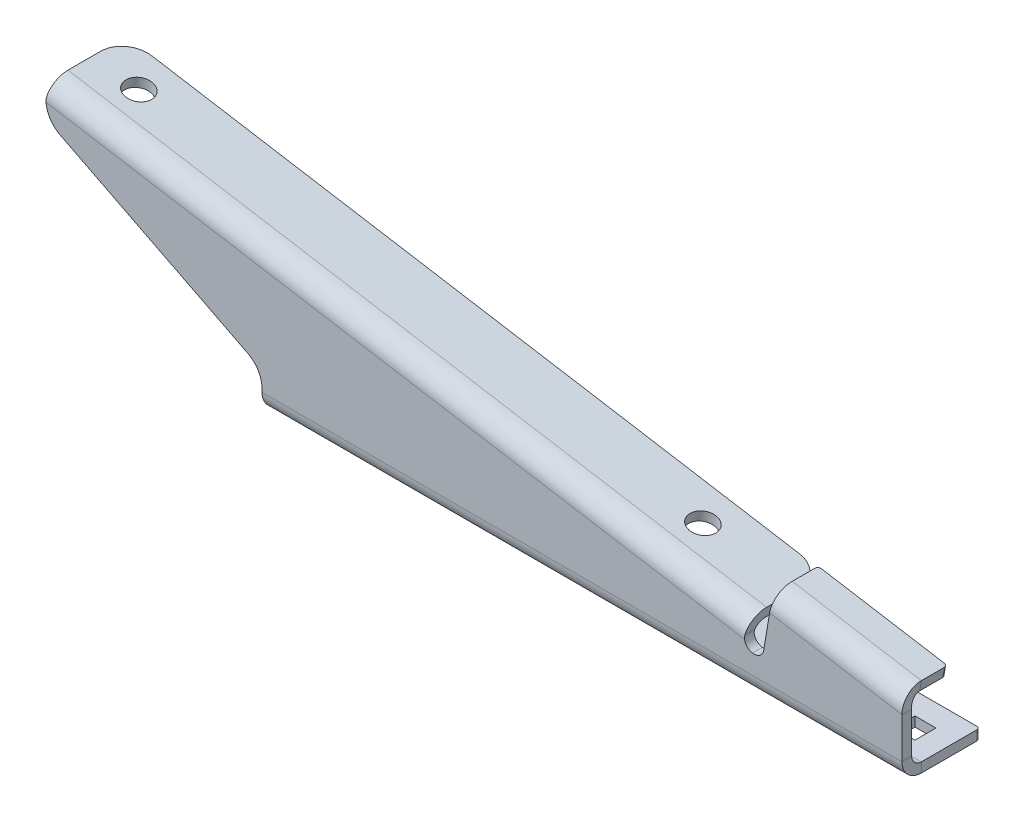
ISO-10303-21;
HEADER;
FILE_DESCRIPTION(('STEP AP214'),'2;1');
FILE_NAME('part.step','',(''),(''),'','','');
FILE_SCHEMA(('AUTOMOTIVE_DESIGN { 1 0 10303 214 1 1 1 1 }'));
ENDSEC;
DATA;
#1=APPLICATION_CONTEXT('core data for automotive mechanical design processes');
#2=APPLICATION_PROTOCOL_DEFINITION('international standard','automotive_design',2000,#1);
#3=PRODUCT_CONTEXT('',#1,'mechanical');
#4=PRODUCT('Part','Part','',(#3));
#5=PRODUCT_RELATED_PRODUCT_CATEGORY('part','',(#4));
#6=PRODUCT_DEFINITION_FORMATION('','',#4);
#7=PRODUCT_DEFINITION_CONTEXT('part definition',#1,'design');
#8=PRODUCT_DEFINITION('design','',#6,#7);
#9=PRODUCT_DEFINITION_SHAPE('','',#8);
#10=(LENGTH_UNIT() NAMED_UNIT(*) SI_UNIT(.MILLI.,.METRE.));
#11=(NAMED_UNIT(*) PLANE_ANGLE_UNIT() SI_UNIT($,.RADIAN.));
#12=(NAMED_UNIT(*) SI_UNIT($,.STERADIAN.) SOLID_ANGLE_UNIT());
#13=UNCERTAINTY_MEASURE_WITH_UNIT(LENGTH_MEASURE(1.E-05),#10,'distance_accuracy_value','');
#14=(GEOMETRIC_REPRESENTATION_CONTEXT(3) GLOBAL_UNCERTAINTY_ASSIGNED_CONTEXT((#13)) GLOBAL_UNIT_ASSIGNED_CONTEXT((#10,
#11,#12)) REPRESENTATION_CONTEXT('',''));
#15=CARTESIAN_POINT('',(0.,0.,0.));
#16=DIRECTION('',(0.,0.,1.));
#17=DIRECTION('',(1.,0.,0.));
#18=AXIS2_PLACEMENT_3D('',#15,#16,#17);
#19=CARTESIAN_POINT('',(12.7,0.,4.7625));
#20=DIRECTION('',(0.,0.,1.));
#21=DIRECTION('',(1.,0.,0.));
#22=AXIS2_PLACEMENT_3D('',#19,#20,#21);
#23=PLANE('',#22);
#24=DIRECTION('',(0.986533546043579,-0.163559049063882,0.));
#25=VECTOR('',#24,1.);
#26=CARTESIAN_POINT('',(-13.9158520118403,12.4641135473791,4.76250000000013));
#27=LINE('',#26,#25);
#28=CARTESIAN_POINT('',(-76.9264794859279,22.9107510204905,4.76250000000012));
#29=VERTEX_POINT('',#28);
#30=CARTESIAN_POINT('',(-418.263799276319,79.5016370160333,4.7625));
#31=VERTEX_POINT('',#30);
#32=EDGE_CURVE('E569',#29,#31,#27,.F.);
#33=ORIENTED_EDGE('',*,*,#32,.T.);
#34=CARTESIAN_POINT('',(-405.596026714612,80.405815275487,4.7625));
#35=DIRECTION('',(0.,0.,1.));
#36=DIRECTION('',(1.,0.,0.));
#37=AXIS2_PLACEMENT_3D('',#34,#35,#36);
#38=CIRCLE('',#37,12.7);
#39=CARTESIAN_POINT('',(-411.342412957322,69.0802227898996,4.7625));
#40=VERTEX_POINT('',#39);
#41=EDGE_CURVE('E644',#31,#40,#38,.T.);
#42=ORIENTED_EDGE('',*,*,#41,.T.);
#43=DIRECTION('',(-0.891778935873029,0.452471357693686,0.));
#44=VECTOR('',#43,1.);
#45=CARTESIAN_POINT('',(-46.2401673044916,-116.165584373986,4.7625));
#46=LINE('',#45,#44);
#47=CARTESIAN_POINT('',(-319.69111375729,22.5781289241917,4.7625));
#48=VERTEX_POINT('',#47);
#49=EDGE_CURVE('E533',#48,#40,#46,.T.);
#50=ORIENTED_EDGE('',*,*,#49,.F.);
#51=CARTESIAN_POINT('',(-325.4375,11.2525364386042,4.7625));
#52=DIRECTION('',(0.,0.,1.));
#53=DIRECTION('',(1.,0.,0.));
#54=AXIS2_PLACEMENT_3D('',#51,#52,#53);
#55=CIRCLE('',#54,12.7);
#56=CARTESIAN_POINT('',(-312.7375,11.2525364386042,4.7625));
#57=VERTEX_POINT('',#56);
#58=EDGE_CURVE('E668',#48,#57,#55,.F.);
#59=ORIENTED_EDGE('',*,*,#58,.T.);
#60=DIRECTION('',(0.,1.,0.));
#61=VECTOR('',#60,1.);
#62=CARTESIAN_POINT('',(-312.7375,0.,4.7625));
#63=LINE('',#62,#61);
#64=CARTESIAN_POINT('',(-312.7375,9.52499999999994,4.7625));
#65=VERTEX_POINT('',#64);
#66=EDGE_CURVE('E536',#65,#57,#63,.T.);
#67=ORIENTED_EDGE('',*,*,#66,.F.);
#68=DIRECTION('',(-1.,0.,0.));
#69=VECTOR('',#68,1.);
#70=CARTESIAN_POINT('',(-431.8,9.52499999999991,4.76250000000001));
#71=LINE('',#70,#69);
#72=CARTESIAN_POINT('',(0.,9.52499999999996,4.7625));
#73=VERTEX_POINT('',#72);
#74=EDGE_CURVE('E591',#65,#73,#71,.F.);
#75=ORIENTED_EDGE('',*,*,#74,.T.);
#76=DIRECTION('',(0.,-1.,0.));
#77=VECTOR('',#76,1.);
#78=CARTESIAN_POINT('',(0.,0.,4.7625));
#79=LINE('',#78,#77);
#80=CARTESIAN_POINT('',(0.,29.4670188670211,4.76249999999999));
#81=VERTEX_POINT('',#80);
#82=EDGE_CURVE('E460',#81,#73,#79,.T.);
#83=ORIENTED_EDGE('',*,*,#82,.F.);
#84=DIRECTION('',(0.986533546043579,-0.163559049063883,0.));
#85=VECTOR('',#84,1.);
#86=CARTESIAN_POINT('',(11.1421000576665,27.6197514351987,4.76249999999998));
#87=LINE('',#86,#85);
#88=CARTESIAN_POINT('',(-64.6826516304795,40.1908640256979,4.7625));
#89=VERTEX_POINT('',#88);
#90=EDGE_CURVE('E492',#81,#89,#87,.F.);
#91=ORIENTED_EDGE('',*,*,#90,.T.);
#92=DIRECTION('',(-0.163559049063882,-0.986533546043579,0.));
#93=VECTOR('',#92,1.);
#94=CARTESIAN_POINT('',(-63.124751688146,49.5875960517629,4.7625));
#95=LINE('',#94,#93);
#96=CARTESIAN_POINT('',(-67.5388015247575,22.9635219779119,4.7625));
#97=VERTEX_POINT('',#96);
#98=EDGE_CURVE('E504',#89,#97,#95,.T.);
#99=ORIENTED_EDGE('',*,*,#98,.T.);
#100=CARTESIAN_POINT('',(-72.2371675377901,23.7424719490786,4.7625));
#101=DIRECTION('',(0.,0.,1.));
#102=DIRECTION('',(1.,0.,0.));
#103=AXIS2_PLACEMENT_3D('',#100,#101,#102);
#104=CIRCLE('',#103,4.7625);
#105=CARTESIAN_POINT('',(-73.0161175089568,19.044105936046,4.7625));
#106=VERTEX_POINT('',#105);
#107=EDGE_CURVE('E601',#97,#106,#104,.F.);
#108=ORIENTED_EDGE('',*,*,#107,.T.);
#109=CARTESIAN_POINT('',(-72.23716753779,23.7424719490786,4.7625));
#110=DIRECTION('',(0.,0.,1.));
#111=DIRECTION('',(1.,0.,0.));
#112=AXIS2_PLACEMENT_3D('',#109,#110,#111);
#113=CIRCLE('',#112,4.7625);
#114=EDGE_CURVE('E605',#106,#29,#113,.F.);
#115=ORIENTED_EDGE('',*,*,#114,.T.);
#116=EDGE_LOOP('',(#33,#42,#50,#59,#67,#75,#83,#91,#99,#108,#115));
#117=FACE_BOUND('',#116,.T.);
#118=ADVANCED_FACE('F95',(#117),#23,.T.);
#119=CARTESIAN_POINT('',(12.7,0.,0.));
#120=DIRECTION('',(0.,0.,1.));
#121=DIRECTION('',(1.,0.,0.));
#122=AXIS2_PLACEMENT_3D('',#119,#120,#121);
#123=PLANE('',#122);
#124=DIRECTION('',(-0.891778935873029,0.452471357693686,0.));
#125=VECTOR('',#124,1.);
#126=CARTESIAN_POINT('',(-46.2401673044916,-116.165584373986,0.));
#127=LINE('',#126,#125);
#128=CARTESIAN_POINT('',(-319.69111375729,22.5781289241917,0.));
#129=VERTEX_POINT('',#128);
#130=CARTESIAN_POINT('',(-411.342412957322,69.0802227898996,0.));
#131=VERTEX_POINT('',#130);
#132=EDGE_CURVE('E532',#129,#131,#127,.T.);
#133=ORIENTED_EDGE('',*,*,#132,.T.);
#134=CARTESIAN_POINT('',(-405.596026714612,80.405815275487,0.));
#135=DIRECTION('',(0.,0.,1.));
#136=DIRECTION('',(1.,0.,0.));
#137=AXIS2_PLACEMENT_3D('',#134,#135,#136);
#138=CIRCLE('',#137,12.7);
#139=CARTESIAN_POINT('',(-418.263799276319,79.5016370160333,0.));
#140=VERTEX_POINT('',#139);
#141=EDGE_CURVE('E665',#131,#140,#138,.F.);
#142=ORIENTED_EDGE('',*,*,#141,.T.);
#143=DIRECTION('',(0.986533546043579,-0.163559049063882,0.));
#144=VECTOR('',#143,1.);
#145=CARTESIAN_POINT('',(-13.9158520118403,12.4641135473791,1.2490009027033E-13));
#146=LINE('',#145,#144);
#147=CARTESIAN_POINT('',(-76.9264794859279,22.9107510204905,1.13890113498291E-13));
#148=VERTEX_POINT('',#147);
#149=EDGE_CURVE('E551',#148,#140,#146,.F.);
#150=ORIENTED_EDGE('',*,*,#149,.F.);
#151=CARTESIAN_POINT('',(-72.23716753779,23.7424719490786,0.));
#152=DIRECTION('',(0.,0.,1.));
#153=DIRECTION('',(1.,0.,0.));
#154=AXIS2_PLACEMENT_3D('',#151,#152,#153);
#155=CIRCLE('',#154,4.7625);
#156=CARTESIAN_POINT('',(-73.0161175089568,19.044105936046,0.));
#157=VERTEX_POINT('',#156);
#158=EDGE_CURVE('E792',#148,#157,#155,.T.);
#159=ORIENTED_EDGE('',*,*,#158,.T.);
#160=CARTESIAN_POINT('',(-72.2371675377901,23.7424719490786,0.));
#161=DIRECTION('',(0.,0.,1.));
#162=DIRECTION('',(1.,0.,0.));
#163=AXIS2_PLACEMENT_3D('',#160,#161,#162);
#164=CIRCLE('',#163,4.7625);
#165=CARTESIAN_POINT('',(-67.5388015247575,22.9635219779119,0.));
#166=VERTEX_POINT('',#165);
#167=EDGE_CURVE('E603',#157,#166,#164,.T.);
#168=ORIENTED_EDGE('',*,*,#167,.T.);
#169=DIRECTION('',(-0.163559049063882,-0.986533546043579,0.));
#170=VECTOR('',#169,1.);
#171=CARTESIAN_POINT('',(-63.124751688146,49.5875960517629,0.));
#172=LINE('',#171,#170);
#173=CARTESIAN_POINT('',(-64.6826516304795,40.1908640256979,0.));
#174=VERTEX_POINT('',#173);
#175=EDGE_CURVE('E505',#174,#166,#172,.T.);
#176=ORIENTED_EDGE('',*,*,#175,.F.);
#177=DIRECTION('',(0.986533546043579,-0.163559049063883,0.));
#178=VECTOR('',#177,1.);
#179=CARTESIAN_POINT('',(11.1421000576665,27.6197514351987,0.));
#180=LINE('',#179,#178);
#181=CARTESIAN_POINT('',(0.,29.4670188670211,0.));
#182=VERTEX_POINT('',#181);
#183=EDGE_CURVE('E474',#182,#174,#180,.F.);
#184=ORIENTED_EDGE('',*,*,#183,.F.);
#185=DIRECTION('',(0.,1.,0.));
#186=VECTOR('',#185,1.);
#187=CARTESIAN_POINT('',(0.,0.,0.));
#188=LINE('',#187,#186);
#189=CARTESIAN_POINT('',(0.,9.52499999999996,0.));
#190=VERTEX_POINT('',#189);
#191=EDGE_CURVE('E461',#182,#190,#188,.F.);
#192=ORIENTED_EDGE('',*,*,#191,.T.);
#193=DIRECTION('',(-1.,0.,0.));
#194=VECTOR('',#193,1.);
#195=CARTESIAN_POINT('',(-431.8,9.52499999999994,0.));
#196=LINE('',#195,#194);
#197=CARTESIAN_POINT('',(-312.7375,9.52499999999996,0.));
#198=VERTEX_POINT('',#197);
#199=EDGE_CURVE('E582',#198,#190,#196,.F.);
#200=ORIENTED_EDGE('',*,*,#199,.F.);
#201=DIRECTION('',(0.,1.,0.));
#202=VECTOR('',#201,1.);
#203=CARTESIAN_POINT('',(-312.7375,0.,0.));
#204=LINE('',#203,#202);
#205=CARTESIAN_POINT('',(-312.7375,11.2525364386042,0.));
#206=VERTEX_POINT('',#205);
#207=EDGE_CURVE('E537',#198,#206,#204,.T.);
#208=ORIENTED_EDGE('',*,*,#207,.T.);
#209=CARTESIAN_POINT('',(-325.4375,11.2525364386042,0.));
#210=DIRECTION('',(0.,0.,1.));
#211=DIRECTION('',(1.,0.,0.));
#212=AXIS2_PLACEMENT_3D('',#209,#210,#211);
#213=CIRCLE('',#212,12.7);
#214=EDGE_CURVE('E670',#206,#129,#213,.T.);
#215=ORIENTED_EDGE('',*,*,#214,.T.);
#216=EDGE_LOOP('',(#133,#142,#150,#159,#168,#176,#184,#192,#200,#208,#215));
#217=FACE_BOUND('',#216,.T.);
#218=ADVANCED_FACE('F776',(#217),#123,.F.);
#219=CARTESIAN_POINT('',(-431.8,9.52499999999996,-4.76249999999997));
#220=DIRECTION('',(-1.,0.,0.));
#221=DIRECTION('',(0.,-1.,0.));
#222=AXIS2_PLACEMENT_3D('',#219,#220,#221);
#223=CYLINDRICAL_SURFACE('',#222,9.52499999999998);
#224=DIRECTION('',(-1.,0.,0.));
#225=VECTOR('',#224,1.);
#226=CARTESIAN_POINT('',(12.7000000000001,0.,-4.76249999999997));
#227=LINE('',#226,#225);
#228=CARTESIAN_POINT('',(-312.7375,0.,-4.76249999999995));
#229=VERTEX_POINT('',#228);
#230=CARTESIAN_POINT('',(0.,0.,-4.76249999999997));
#231=VERTEX_POINT('',#230);
#232=EDGE_CURVE('E586',#229,#231,#227,.F.);
#233=ORIENTED_EDGE('',*,*,#232,.T.);
#234=CARTESIAN_POINT('',(0.,9.52499999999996,-4.76250000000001));
#235=DIRECTION('',(-1.,0.,0.));
#236=DIRECTION('',(0.,0.,1.));
#237=AXIS2_PLACEMENT_3D('',#234,#235,#236);
#238=CIRCLE('',#237,9.52499999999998);
#239=EDGE_CURVE('E438',#73,#231,#238,.F.);
#240=ORIENTED_EDGE('',*,*,#239,.F.);
#241=ORIENTED_EDGE('',*,*,#74,.F.);
#242=CARTESIAN_POINT('',(-312.7375,9.52499999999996,-4.76249999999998));
#243=DIRECTION('',(1.,0.,0.));
#244=DIRECTION('',(0.,0.,-1.));
#245=AXIS2_PLACEMENT_3D('',#242,#243,#244);
#246=CIRCLE('',#245,9.52499999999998);
#247=EDGE_CURVE('E520',#229,#65,#246,.F.);
#248=ORIENTED_EDGE('',*,*,#247,.F.);
#249=EDGE_LOOP('',(#233,#240,#241,#248));
#250=FACE_BOUND('',#249,.T.);
#251=ADVANCED_FACE('F755',(#250),#223,.T.);
#252=CARTESIAN_POINT('',(-431.8,9.52499999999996,-4.76249999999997));
#253=DIRECTION('',(-1.,0.,0.));
#254=DIRECTION('',(0.,-1.,0.));
#255=AXIS2_PLACEMENT_3D('',#252,#253,#254);
#256=CYLINDRICAL_SURFACE('',#255,4.76249999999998);
#257=CARTESIAN_POINT('',(0.,9.52499999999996,-4.76250000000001));
#258=DIRECTION('',(-1.,0.,0.));
#259=DIRECTION('',(0.,0.,1.));
#260=AXIS2_PLACEMENT_3D('',#257,#258,#259);
#261=CIRCLE('',#260,4.76249999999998);
#262=CARTESIAN_POINT('',(0.,4.76249999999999,-4.76249999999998));
#263=VERTEX_POINT('',#262);
#264=EDGE_CURVE('E434',#190,#263,#261,.F.);
#265=ORIENTED_EDGE('',*,*,#264,.T.);
#266=DIRECTION('',(-1.,0.,0.));
#267=VECTOR('',#266,1.);
#268=CARTESIAN_POINT('',(12.7000000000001,4.76249999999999,-4.76249999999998));
#269=LINE('',#268,#267);
#270=CARTESIAN_POINT('',(-312.7375,4.76249999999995,-4.76249999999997));
#271=VERTEX_POINT('',#270);
#272=EDGE_CURVE('E575',#263,#271,#269,.T.);
#273=ORIENTED_EDGE('',*,*,#272,.T.);
#274=CARTESIAN_POINT('',(-312.7375,9.52499999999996,-4.76249999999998));
#275=DIRECTION('',(-1.,0.,0.));
#276=DIRECTION('',(0.,0.,1.));
#277=AXIS2_PLACEMENT_3D('',#274,#275,#276);
#278=CIRCLE('',#277,4.76249999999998);
#279=EDGE_CURVE('E521',#271,#198,#278,.T.);
#280=ORIENTED_EDGE('',*,*,#279,.T.);
#281=ORIENTED_EDGE('',*,*,#199,.T.);
#282=EDGE_LOOP('',(#265,#273,#280,#281));
#283=FACE_BOUND('',#282,.T.);
#284=ADVANCED_FACE('F878',(#283),#256,.F.);
#285=CARTESIAN_POINT('',(12.7,0.,0.));
#286=DIRECTION('',(0.,1.,0.));
#287=DIRECTION('',(0.,0.,1.));
#288=AXIS2_PLACEMENT_3D('',#285,#286,#287);
#289=PLANE('',#288);
#290=DIRECTION('',(1.,0.,0.));
#291=VECTOR('',#290,1.);
#292=CARTESIAN_POINT('',(-21.0185,0.,-22.606));
#293=LINE('',#292,#291);
#294=CARTESIAN_POINT('',(-21.0185,0.,-22.606));
#295=VERTEX_POINT('',#294);
#296=CARTESIAN_POINT('',(-10.7315,0.,-22.606));
#297=VERTEX_POINT('',#296);
#298=EDGE_CURVE('E380',#295,#297,#293,.T.);
#299=ORIENTED_EDGE('',*,*,#298,.F.);
#300=DIRECTION('',(0.,0.,-1.));
#301=VECTOR('',#300,1.);
#302=CARTESIAN_POINT('',(-21.0185,0.,-12.319));
#303=LINE('',#302,#301);
#304=CARTESIAN_POINT('',(-21.0185,0.,-12.319));
#305=VERTEX_POINT('',#304);
#306=EDGE_CURVE('E353',#305,#295,#303,.T.);
#307=ORIENTED_EDGE('',*,*,#306,.F.);
#308=DIRECTION('',(-1.,0.,0.));
#309=VECTOR('',#308,1.);
#310=CARTESIAN_POINT('',(-21.0185,0.,-12.319));
#311=LINE('',#310,#309);
#312=CARTESIAN_POINT('',(-10.7315,0.,-12.319));
#313=VERTEX_POINT('',#312);
#314=EDGE_CURVE('E371',#313,#305,#311,.T.);
#315=ORIENTED_EDGE('',*,*,#314,.F.);
#316=DIRECTION('',(0.,0.,1.));
#317=VECTOR('',#316,1.);
#318=CARTESIAN_POINT('',(-10.7315,0.,-12.319));
#319=LINE('',#318,#317);
#320=EDGE_CURVE('E374',#297,#313,#319,.T.);
#321=ORIENTED_EDGE('',*,*,#320,.F.);
#322=EDGE_LOOP('',(#299,#307,#315,#321));
#323=FACE_BOUND('',#322,.T.);
#324=DIRECTION('',(1.,0.,0.));
#325=VECTOR('',#324,1.);
#326=CARTESIAN_POINT('',(-300.4185,-1.14666786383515E-13,-22.606));
#327=LINE('',#326,#325);
#328=CARTESIAN_POINT('',(-300.4185,-1.14442877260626E-13,-22.606));
#329=VERTEX_POINT('',#328);
#330=CARTESIAN_POINT('',(-290.1315,-1.13443026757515E-13,-22.606));
#331=VERTEX_POINT('',#330);
#332=EDGE_CURVE('E405',#329,#331,#327,.T.);
#333=ORIENTED_EDGE('',*,*,#332,.F.);
#334=DIRECTION('',(0.,0.,-1.));
#335=VECTOR('',#334,1.);
#336=CARTESIAN_POINT('',(-300.4185,0.,-12.319));
#337=LINE('',#336,#335);
#338=CARTESIAN_POINT('',(-300.4185,0.,-12.319));
#339=VERTEX_POINT('',#338);
#340=EDGE_CURVE('E386',#339,#329,#337,.T.);
#341=ORIENTED_EDGE('',*,*,#340,.F.);
#342=DIRECTION('',(-1.,0.,0.));
#343=VECTOR('',#342,1.);
#344=CARTESIAN_POINT('',(-300.4185,0.,-12.319));
#345=LINE('',#344,#343);
#346=CARTESIAN_POINT('',(-290.1315,0.,-12.319));
#347=VERTEX_POINT('',#346);
#348=EDGE_CURVE('E394',#347,#339,#345,.T.);
#349=ORIENTED_EDGE('',*,*,#348,.F.);
#350=DIRECTION('',(0.,0.,1.));
#351=VECTOR('',#350,1.);
#352=CARTESIAN_POINT('',(-290.1315,0.,-12.319));
#353=LINE('',#352,#351);
#354=EDGE_CURVE('E408',#331,#347,#353,.T.);
#355=ORIENTED_EDGE('',*,*,#354,.F.);
#356=EDGE_LOOP('',(#333,#341,#349,#355));
#357=FACE_BOUND('',#356,.T.);
#358=DIRECTION('',(0.,0.,1.));
#359=VECTOR('',#358,1.);
#360=CARTESIAN_POINT('',(-312.7375,0.,-33.3375));
#361=LINE('',#360,#359);
#362=CARTESIAN_POINT('',(-312.7375,0.,-31.75));
#363=VERTEX_POINT('',#362);
#364=EDGE_CURVE('E524',#363,#229,#361,.T.);
#365=ORIENTED_EDGE('',*,*,#364,.F.);
#366=CARTESIAN_POINT('',(-311.15,-1.47645639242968E-13,-31.75));
#367=DIRECTION('',(0.,1.,0.));
#368=DIRECTION('',(0.,0.,1.));
#369=AXIS2_PLACEMENT_3D('',#366,#367,#368);
#370=CIRCLE('',#369,1.5875);
#371=CARTESIAN_POINT('',(-311.15,-1.5318836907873E-13,-33.3375));
#372=VERTEX_POINT('',#371);
#373=EDGE_CURVE('E704',#363,#372,#370,.F.);
#374=ORIENTED_EDGE('',*,*,#373,.T.);
#375=DIRECTION('',(1.,0.,0.));
#376=VECTOR('',#375,1.);
#377=CARTESIAN_POINT('',(-431.8,-1.67541105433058E-13,-33.3375));
#378=LINE('',#377,#376);
#379=CARTESIAN_POINT('',(-1.58750000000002,-1.1636226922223E-13,-33.3375));
#380=VERTEX_POINT('',#379);
#381=EDGE_CURVE('E579',#380,#372,#378,.F.);
#382=ORIENTED_EDGE('',*,*,#381,.F.);
#383=CARTESIAN_POINT('',(-1.58750000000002,-1.10819539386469E-13,-31.75));
#384=DIRECTION('',(0.,1.,0.));
#385=DIRECTION('',(0.,0.,1.));
#386=AXIS2_PLACEMENT_3D('',#383,#384,#385);
#387=CIRCLE('',#386,1.5875);
#388=CARTESIAN_POINT('',(0.,-1.10630687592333E-13,-31.75));
#389=VERTEX_POINT('',#388);
#390=EDGE_CURVE('E702',#380,#389,#387,.F.);
#391=ORIENTED_EDGE('',*,*,#390,.T.);
#392=DIRECTION('',(0.,0.,1.));
#393=VECTOR('',#392,1.);
#394=CARTESIAN_POINT('',(0.,0.,0.));
#395=LINE('',#394,#393);
#396=EDGE_CURVE('E441',#389,#231,#395,.T.);
#397=ORIENTED_EDGE('',*,*,#396,.T.);
#398=ORIENTED_EDGE('',*,*,#232,.F.);
#399=EDGE_LOOP('',(#365,#374,#382,#391,#397,#398));
#400=FACE_BOUND('',#399,.T.);
#401=ADVANCED_FACE('F739',(#323,#357,#400),#289,.F.);
#402=CARTESIAN_POINT('',(12.7,4.7625,0.));
#403=DIRECTION('',(0.,1.,0.));
#404=DIRECTION('',(0.,0.,1.));
#405=AXIS2_PLACEMENT_3D('',#402,#403,#404);
#406=PLANE('',#405);
#407=DIRECTION('',(0.,0.,-1.));
#408=VECTOR('',#407,1.);
#409=CARTESIAN_POINT('',(-21.0185,4.76249999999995,-12.319));
#410=LINE('',#409,#408);
#411=CARTESIAN_POINT('',(-21.0185,4.76249999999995,-12.319));
#412=VERTEX_POINT('',#411);
#413=CARTESIAN_POINT('',(-21.0185,4.76249999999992,-22.606));
#414=VERTEX_POINT('',#413);
#415=EDGE_CURVE('E350',#412,#414,#410,.T.);
#416=ORIENTED_EDGE('',*,*,#415,.T.);
#417=DIRECTION('',(1.,0.,0.));
#418=VECTOR('',#417,1.);
#419=CARTESIAN_POINT('',(-21.0185,4.76249999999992,-22.606));
#420=LINE('',#419,#418);
#421=CARTESIAN_POINT('',(-10.7315,4.76249999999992,-22.606));
#422=VERTEX_POINT('',#421);
#423=EDGE_CURVE('E362',#414,#422,#420,.T.);
#424=ORIENTED_EDGE('',*,*,#423,.T.);
#425=DIRECTION('',(0.,0.,1.));
#426=VECTOR('',#425,1.);
#427=CARTESIAN_POINT('',(-10.7315,4.76249999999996,-12.319));
#428=LINE('',#427,#426);
#429=CARTESIAN_POINT('',(-10.7315,4.76249999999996,-12.319));
#430=VERTEX_POINT('',#429);
#431=EDGE_CURVE('E366',#422,#430,#428,.T.);
#432=ORIENTED_EDGE('',*,*,#431,.T.);
#433=DIRECTION('',(-1.,0.,0.));
#434=VECTOR('',#433,1.);
#435=CARTESIAN_POINT('',(-21.0185,4.76249999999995,-12.319));
#436=LINE('',#435,#434);
#437=EDGE_CURVE('E358',#430,#412,#436,.T.);
#438=ORIENTED_EDGE('',*,*,#437,.T.);
#439=EDGE_LOOP('',(#416,#424,#432,#438));
#440=FACE_BOUND('',#439,.T.);
#441=DIRECTION('',(0.,0.,-1.));
#442=VECTOR('',#441,1.);
#443=CARTESIAN_POINT('',(-300.4185,4.76249999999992,-12.319));
#444=LINE('',#443,#442);
#445=CARTESIAN_POINT('',(-300.4185,4.76249999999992,-12.319));
#446=VERTEX_POINT('',#445);
#447=CARTESIAN_POINT('',(-300.4185,4.76249999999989,-22.606));
#448=VERTEX_POINT('',#447);
#449=EDGE_CURVE('E390',#446,#448,#444,.T.);
#450=ORIENTED_EDGE('',*,*,#449,.T.);
#451=DIRECTION('',(1.,0.,0.));
#452=VECTOR('',#451,1.);
#453=CARTESIAN_POINT('',(-300.4185,4.76249999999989,-22.606));
#454=LINE('',#453,#452);
#455=CARTESIAN_POINT('',(-290.1315,4.76249999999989,-22.606));
#456=VERTEX_POINT('',#455);
#457=EDGE_CURVE('E393',#448,#456,#454,.T.);
#458=ORIENTED_EDGE('',*,*,#457,.T.);
#459=DIRECTION('',(0.,0.,1.));
#460=VECTOR('',#459,1.);
#461=CARTESIAN_POINT('',(-290.1315,4.76249999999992,-12.319));
#462=LINE('',#461,#460);
#463=CARTESIAN_POINT('',(-290.1315,4.76249999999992,-12.319));
#464=VERTEX_POINT('',#463);
#465=EDGE_CURVE('E397',#456,#464,#462,.T.);
#466=ORIENTED_EDGE('',*,*,#465,.T.);
#467=DIRECTION('',(-1.,0.,0.));
#468=VECTOR('',#467,1.);
#469=CARTESIAN_POINT('',(-300.4185,4.76249999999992,-12.319));
#470=LINE('',#469,#468);
#471=EDGE_CURVE('E400',#464,#446,#470,.T.);
#472=ORIENTED_EDGE('',*,*,#471,.T.);
#473=EDGE_LOOP('',(#450,#458,#466,#472));
#474=FACE_BOUND('',#473,.T.);
#475=DIRECTION('',(-1.,0.,0.));
#476=VECTOR('',#475,1.);
#477=CARTESIAN_POINT('',(12.7,4.76249999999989,-33.3375));
#478=LINE('',#477,#476);
#479=CARTESIAN_POINT('',(-1.58750000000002,4.76249999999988,-33.3375));
#480=VERTEX_POINT('',#479);
#481=CARTESIAN_POINT('',(-311.15,4.76249999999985,-33.3375));
#482=VERTEX_POINT('',#481);
#483=EDGE_CURVE('E583',#480,#482,#478,.T.);
#484=ORIENTED_EDGE('',*,*,#483,.T.);
#485=CARTESIAN_POINT('',(-311.15,4.76249999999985,-31.75));
#486=DIRECTION('',(0.,1.,0.));
#487=DIRECTION('',(0.,0.,1.));
#488=AXIS2_PLACEMENT_3D('',#485,#486,#487);
#489=CIRCLE('',#488,1.5875);
#490=CARTESIAN_POINT('',(-312.7375,4.76249999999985,-31.75));
#491=VERTEX_POINT('',#490);
#492=EDGE_CURVE('E698',#482,#491,#489,.T.);
#493=ORIENTED_EDGE('',*,*,#492,.T.);
#494=DIRECTION('',(0.,0.,1.));
#495=VECTOR('',#494,1.);
#496=CARTESIAN_POINT('',(-312.7375,4.76249999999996,0.));
#497=LINE('',#496,#495);
#498=EDGE_CURVE('E526',#491,#271,#497,.T.);
#499=ORIENTED_EDGE('',*,*,#498,.T.);
#500=ORIENTED_EDGE('',*,*,#272,.F.);
#501=DIRECTION('',(0.,0.,1.));
#502=VECTOR('',#501,1.);
#503=CARTESIAN_POINT('',(0.,4.7625,0.));
#504=LINE('',#503,#502);
#505=CARTESIAN_POINT('',(0.,4.76249999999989,-31.75));
#506=VERTEX_POINT('',#505);
#507=EDGE_CURVE('E437',#506,#263,#504,.T.);
#508=ORIENTED_EDGE('',*,*,#507,.F.);
#509=CARTESIAN_POINT('',(-1.58750000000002,4.76249999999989,-31.75));
#510=DIRECTION('',(0.,1.,0.));
#511=DIRECTION('',(0.,0.,1.));
#512=AXIS2_PLACEMENT_3D('',#509,#510,#511);
#513=CIRCLE('',#512,1.5875);
#514=EDGE_CURVE('E696',#506,#480,#513,.T.);
#515=ORIENTED_EDGE('',*,*,#514,.T.);
#516=EDGE_LOOP('',(#484,#493,#499,#500,#508,#515));
#517=FACE_BOUND('',#516,.T.);
#518=ADVANCED_FACE('F368',(#440,#474,#517),#406,.T.);
#519=CARTESIAN_POINT('',(-431.8,-1.67400815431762E-13,-33.3375));
#520=DIRECTION('',(0.,0.,-1.));
#521=DIRECTION('',(0.,1.,0.));
#522=AXIS2_PLACEMENT_3D('',#519,#520,#521);
#523=PLANE('',#522);
#524=ORIENTED_EDGE('',*,*,#381,.T.);
#525=DIRECTION('',(0.,1.,0.));
#526=VECTOR('',#525,1.);
#527=CARTESIAN_POINT('',(-311.15,-1.53048079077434E-13,-33.3375));
#528=LINE('',#527,#526);
#529=EDGE_CURVE('E693',#372,#482,#528,.T.);
#530=ORIENTED_EDGE('',*,*,#529,.T.);
#531=ORIENTED_EDGE('',*,*,#483,.F.);
#532=DIRECTION('',(0.,1.,0.));
#533=VECTOR('',#532,1.);
#534=CARTESIAN_POINT('',(-1.58750000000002,-1.16221979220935E-13,-33.3375));
#535=LINE('',#534,#533);
#536=EDGE_CURVE('E690',#480,#380,#535,.F.);
#537=ORIENTED_EDGE('',*,*,#536,.T.);
#538=EDGE_LOOP('',(#524,#530,#531,#537));
#539=FACE_BOUND('',#538,.T.);
#540=ADVANCED_FACE('F735',(#539),#523,.T.);
#541=CARTESIAN_POINT('',(11.1421000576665,27.6197514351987,-4.76250000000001));
#542=DIRECTION('',(0.986533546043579,-0.163559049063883,0.));
#543=DIRECTION('',(0.163559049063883,0.986533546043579,0.));
#544=AXIS2_PLACEMENT_3D('',#541,#542,#543);
#545=CYLINDRICAL_SURFACE('',#544,9.52499999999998);
#546=ORIENTED_EDGE('',*,*,#90,.F.);
#547=CARTESIAN_POINT('',(0.,29.4670188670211,-4.76250000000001));
#548=DIRECTION('',(-1.,0.,0.));
#549=DIRECTION('',(0.,-1.,0.));
#550=AXIS2_PLACEMENT_3D('',#547,#548,#549);
#551=ELLIPSE('',#550,9.6550188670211,9.52499999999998);
#552=CARTESIAN_POINT('',(0.,39.1220377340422,-4.76249999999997));
#553=VERTEX_POINT('',#552);
#554=EDGE_CURVE('E447',#553,#81,#551,.F.);
#555=ORIENTED_EDGE('',*,*,#554,.F.);
#556=DIRECTION('',(0.986533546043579,-0.163559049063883,0.));
#557=VECTOR('',#556,1.);
#558=CARTESIAN_POINT('',(12.7,37.0164834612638,-4.76249999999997));
#559=LINE('',#558,#557);
#560=CARTESIAN_POINT('',(-63.124751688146,49.5875960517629,-4.76249999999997));
#561=VERTEX_POINT('',#560);
#562=EDGE_CURVE('E484',#561,#553,#559,.T.);
#563=ORIENTED_EDGE('',*,*,#562,.F.);
#564=CARTESIAN_POINT('',(-64.6826516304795,40.1908640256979,-4.76250000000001));
#565=DIRECTION('',(0.986533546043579,-0.163559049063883,0.));
#566=DIRECTION('',(0.163559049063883,0.986533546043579,0.));
#567=AXIS2_PLACEMENT_3D('',#564,#565,#566);
#568=CIRCLE('',#567,9.52499999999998);
#569=EDGE_CURVE('E494',#89,#561,#568,.F.);
#570=ORIENTED_EDGE('',*,*,#569,.F.);
#571=EDGE_LOOP('',(#546,#555,#563,#570));
#572=FACE_BOUND('',#571,.T.);
#573=ADVANCED_FACE('F860',(#572),#545,.T.);
#574=CARTESIAN_POINT('',(11.1421000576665,27.6197514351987,-4.76250000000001));
#575=DIRECTION('',(0.986533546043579,-0.163559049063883,0.));
#576=DIRECTION('',(0.163559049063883,0.986533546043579,0.));
#577=AXIS2_PLACEMENT_3D('',#574,#575,#576);
#578=CYLINDRICAL_SURFACE('',#577,4.76249999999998);
#579=CARTESIAN_POINT('',(0.,29.4670188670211,-4.76250000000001));
#580=DIRECTION('',(-0.987875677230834,-0.155247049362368,0.));
#581=DIRECTION('',(0.155247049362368,-0.987875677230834,0.));
#582=AXIS2_PLACEMENT_3D('',#579,#580,#581);
#583=ELLIPSE('',#582,5.01748647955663,4.76249999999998);
#584=CARTESIAN_POINT('',(-0.778949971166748,34.4236717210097,-4.76249999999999));
#585=VERTEX_POINT('',#584);
#586=EDGE_CURVE('E448',#585,#182,#583,.F.);
#587=ORIENTED_EDGE('',*,*,#586,.T.);
#588=ORIENTED_EDGE('',*,*,#183,.T.);
#589=CARTESIAN_POINT('',(-64.6826516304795,40.1908640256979,-4.76250000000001));
#590=DIRECTION('',(0.986533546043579,-0.163559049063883,0.));
#591=DIRECTION('',(0.163559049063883,0.986533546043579,0.));
#592=AXIS2_PLACEMENT_3D('',#589,#590,#591);
#593=CIRCLE('',#592,4.76249999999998);
#594=CARTESIAN_POINT('',(-63.9037016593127,44.8892300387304,-4.76249999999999));
#595=VERTEX_POINT('',#594);
#596=EDGE_CURVE('E495',#174,#595,#593,.F.);
#597=ORIENTED_EDGE('',*,*,#596,.T.);
#598=DIRECTION('',(-0.986533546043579,0.163559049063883,0.));
#599=VECTOR('',#598,1.);
#600=CARTESIAN_POINT('',(-63.9037016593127,44.8892300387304,-4.76249999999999));
#601=LINE('',#600,#599);
#602=EDGE_CURVE('E487',#595,#585,#601,.F.);
#603=ORIENTED_EDGE('',*,*,#602,.T.);
#604=EDGE_LOOP('',(#587,#588,#597,#603));
#605=FACE_BOUND('',#604,.T.);
#606=ADVANCED_FACE('F836',(#605),#578,.F.);
#607=CARTESIAN_POINT('',(12.7,37.0164834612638,0.));
#608=DIRECTION('',(0.163559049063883,0.986533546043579,0.));
#609=DIRECTION('',(-0.986533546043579,0.163559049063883,0.));
#610=AXIS2_PLACEMENT_3D('',#607,#608,#609);
#611=PLANE('',#610);
#612=DIRECTION('',(0.986533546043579,-0.163559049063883,0.));
#613=VECTOR('',#612,1.);
#614=CARTESIAN_POINT('',(12.7,37.0164834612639,-17.4625));
#615=LINE('',#614,#613);
#616=CARTESIAN_POINT('',(-61.5586296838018,49.3279460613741,-17.4625));
#617=VERTEX_POINT('',#616);
#618=CARTESIAN_POINT('',(-1.56612200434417,39.3816877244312,-17.4625));
#619=VERTEX_POINT('',#618);
#620=EDGE_CURVE('E472',#617,#619,#615,.T.);
#621=ORIENTED_EDGE('',*,*,#620,.F.);
#622=CARTESIAN_POINT('',(-61.5586296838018,49.3279460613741,-15.875));
#623=DIRECTION('',(0.163559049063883,0.986533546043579,0.));
#624=DIRECTION('',(-0.986533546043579,0.163559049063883,0.));
#625=AXIS2_PLACEMENT_3D('',#622,#623,#624);
#626=CIRCLE('',#625,1.5875);
#627=CARTESIAN_POINT('',(-63.124751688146,49.587596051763,-15.875));
#628=VERTEX_POINT('',#627);
#629=EDGE_CURVE('E719',#617,#628,#626,.T.);
#630=ORIENTED_EDGE('',*,*,#629,.T.);
#631=DIRECTION('',(0.,0.,-1.));
#632=VECTOR('',#631,1.);
#633=CARTESIAN_POINT('',(-63.124751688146,49.587596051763,-17.4625));
#634=LINE('',#633,#632);
#635=EDGE_CURVE('E475',#561,#628,#634,.T.);
#636=ORIENTED_EDGE('',*,*,#635,.F.);
#637=ORIENTED_EDGE('',*,*,#562,.T.);
#638=DIRECTION('',(0.,0.,1.));
#639=VECTOR('',#638,1.);
#640=CARTESIAN_POINT('',(0.,39.1220377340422,-33.3375));
#641=LINE('',#640,#639);
#642=CARTESIAN_POINT('',(0.,39.1220377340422,-15.875));
#643=VERTEX_POINT('',#642);
#644=EDGE_CURVE('E451',#643,#553,#641,.T.);
#645=ORIENTED_EDGE('',*,*,#644,.F.);
#646=CARTESIAN_POINT('',(-1.56612200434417,39.3816877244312,-15.875));
#647=DIRECTION('',(0.163559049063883,0.986533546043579,0.));
#648=DIRECTION('',(-0.986533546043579,0.163559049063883,0.));
#649=AXIS2_PLACEMENT_3D('',#646,#647,#648);
#650=CIRCLE('',#649,1.5875);
#651=EDGE_CURVE('E115',#643,#619,#650,.T.);
#652=ORIENTED_EDGE('',*,*,#651,.T.);
#653=EDGE_LOOP('',(#621,#630,#636,#637,#645,#652));
#654=FACE_BOUND('',#653,.T.);
#655=ADVANCED_FACE('F861',(#654),#611,.T.);
#656=CARTESIAN_POINT('',(11.9210500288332,32.3181174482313,0.));
#657=DIRECTION('',(0.163559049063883,0.986533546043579,0.));
#658=DIRECTION('',(-0.986533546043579,0.163559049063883,0.));
#659=AXIS2_PLACEMENT_3D('',#656,#657,#658);
#660=PLANE('',#659);
#661=DIRECTION('',(0.,0.,1.));
#662=VECTOR('',#661,1.);
#663=CARTESIAN_POINT('',(-63.9037016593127,44.8892300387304,0.));
#664=LINE('',#663,#662);
#665=CARTESIAN_POINT('',(-63.9037016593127,44.8892300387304,-15.875));
#666=VERTEX_POINT('',#665);
#667=EDGE_CURVE('E481',#595,#666,#664,.F.);
#668=ORIENTED_EDGE('',*,*,#667,.T.);
#669=CARTESIAN_POINT('',(-62.3375796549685,44.6295800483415,-15.875));
#670=DIRECTION('',(0.163559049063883,0.986533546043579,0.));
#671=DIRECTION('',(-0.986533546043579,0.163559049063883,0.));
#672=AXIS2_PLACEMENT_3D('',#669,#670,#671);
#673=CIRCLE('',#672,1.5875);
#674=CARTESIAN_POINT('',(-62.3375796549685,44.6295800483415,-17.4625));
#675=VERTEX_POINT('',#674);
#676=EDGE_CURVE('E711',#666,#675,#673,.F.);
#677=ORIENTED_EDGE('',*,*,#676,.T.);
#678=DIRECTION('',(-0.986533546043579,0.163559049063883,0.));
#679=VECTOR('',#678,1.);
#680=CARTESIAN_POINT('',(11.9210500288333,32.3181174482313,-17.4625));
#681=LINE('',#680,#679);
#682=CARTESIAN_POINT('',(-2.34507197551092,34.6833217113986,-17.4625));
#683=VERTEX_POINT('',#682);
#684=EDGE_CURVE('E478',#675,#683,#681,.F.);
#685=ORIENTED_EDGE('',*,*,#684,.T.);
#686=CARTESIAN_POINT('',(-2.34507197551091,34.6833217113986,-15.875));
#687=DIRECTION('',(0.163559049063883,0.986533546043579,0.));
#688=DIRECTION('',(-0.986533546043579,0.163559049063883,0.));
#689=AXIS2_PLACEMENT_3D('',#686,#687,#688);
#690=CIRCLE('',#689,1.5875);
#691=CARTESIAN_POINT('',(-0.778949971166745,34.4236717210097,-15.875));
#692=VERTEX_POINT('',#691);
#693=EDGE_CURVE('E709',#683,#692,#690,.F.);
#694=ORIENTED_EDGE('',*,*,#693,.T.);
#695=DIRECTION('',(0.,0.,1.));
#696=VECTOR('',#695,1.);
#697=CARTESIAN_POINT('',(-0.778949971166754,34.4236717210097,0.));
#698=LINE('',#697,#696);
#699=EDGE_CURVE('E454',#692,#585,#698,.T.);
#700=ORIENTED_EDGE('',*,*,#699,.T.);
#701=ORIENTED_EDGE('',*,*,#602,.F.);
#702=EDGE_LOOP('',(#668,#677,#685,#694,#700,#701));
#703=FACE_BOUND('',#702,.T.);
#704=ADVANCED_FACE('F839',(#703),#660,.F.);
#705=CARTESIAN_POINT('',(12.7,37.0164834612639,-17.4625));
#706=DIRECTION('',(0.,0.,-1.));
#707=DIRECTION('',(0.,1.,0.));
#708=AXIS2_PLACEMENT_3D('',#705,#706,#707);
#709=PLANE('',#708);
#710=ORIENTED_EDGE('',*,*,#684,.F.);
#711=DIRECTION('',(-0.163559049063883,-0.986533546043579,0.));
#712=VECTOR('',#711,1.);
#713=CARTESIAN_POINT('',(-61.5586296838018,49.3279460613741,-17.4625));
#714=LINE('',#713,#712);
#715=EDGE_CURVE('E716',#675,#617,#714,.F.);
#716=ORIENTED_EDGE('',*,*,#715,.T.);
#717=ORIENTED_EDGE('',*,*,#620,.T.);
#718=DIRECTION('',(0.163559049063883,0.986533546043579,0.));
#719=VECTOR('',#718,1.);
#720=CARTESIAN_POINT('',(-1.56612200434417,39.3816877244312,-17.4625));
#721=LINE('',#720,#719);
#722=EDGE_CURVE('E713',#619,#683,#721,.F.);
#723=ORIENTED_EDGE('',*,*,#722,.T.);
#724=EDGE_LOOP('',(#710,#716,#717,#723));
#725=FACE_BOUND('',#724,.T.);
#726=ADVANCED_FACE('F851',(#725),#709,.T.);
#727=CARTESIAN_POINT('',(-418.609780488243,79.5589978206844,-4.76249999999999));
#728=DIRECTION('',(-0.986533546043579,0.163559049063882,0.));
#729=DIRECTION('',(-0.163559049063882,-0.986533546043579,0.));
#730=AXIS2_PLACEMENT_3D('',#727,#728,#729);
#731=PLANE('',#730);
#732=CARTESIAN_POINT('',(-418.609780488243,79.5589978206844,-4.76249999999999));
#733=DIRECTION('',(0.986533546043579,-0.163559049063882,0.));
#734=DIRECTION('',(0.163559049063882,0.986533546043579,0.));
#735=AXIS2_PLACEMENT_3D('',#732,#733,#734);
#736=CIRCLE('',#735,4.76250000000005);
#737=CARTESIAN_POINT('',(-418.125002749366,82.4830151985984,-1.0346964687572));
#738=VERTEX_POINT('',#737);
#739=CARTESIAN_POINT('',(-417.830830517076,84.257363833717,-4.76249999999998));
#740=VERTEX_POINT('',#739);
#741=EDGE_CURVE('E573',#738,#740,#736,.F.);
#742=ORIENTED_EDGE('',*,*,#741,.F.);
#743=DIRECTION('',(0.,0.,-1.));
#744=VECTOR('',#743,1.);
#745=CARTESIAN_POINT('',(-418.125002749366,82.4830151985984,-4.76249999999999));
#746=LINE('',#745,#744);
#747=CARTESIAN_POINT('',(-418.125002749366,82.4830151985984,4.2896123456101));
#748=VERTEX_POINT('',#747);
#749=EDGE_CURVE('E645',#738,#748,#746,.F.);
#750=ORIENTED_EDGE('',*,*,#749,.T.);
#751=CARTESIAN_POINT('',(-418.609780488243,79.5589978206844,-4.76249999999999));
#752=DIRECTION('',(0.986533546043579,-0.163559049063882,0.));
#753=DIRECTION('',(0.163559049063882,0.986533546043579,0.));
#754=AXIS2_PLACEMENT_3D('',#751,#752,#753);
#755=CIRCLE('',#754,9.52500000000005);
#756=CARTESIAN_POINT('',(-417.05188054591,88.9557298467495,-4.76249999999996));
#757=VERTEX_POINT('',#756);
#758=EDGE_CURVE('E572',#748,#757,#755,.F.);
#759=ORIENTED_EDGE('',*,*,#758,.T.);
#760=DIRECTION('',(0.163559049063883,0.986533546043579,0.));
#761=VECTOR('',#760,1.);
#762=CARTESIAN_POINT('',(-417.05188054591,88.9557298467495,-4.76249999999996));
#763=LINE('',#762,#761);
#764=EDGE_CURVE('E547',#740,#757,#763,.T.);
#765=ORIENTED_EDGE('',*,*,#764,.F.);
#766=EDGE_LOOP('',(#742,#750,#759,#765));
#767=FACE_BOUND('',#766,.T.);
#768=ADVANCED_FACE('F630',(#767),#731,.T.);
#769=CARTESIAN_POINT('',(-13.9158520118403,12.4641135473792,-4.76249999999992));
#770=DIRECTION('',(0.986533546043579,-0.163559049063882,0.));
#771=DIRECTION('',(0.163559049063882,0.986533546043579,0.));
#772=AXIS2_PLACEMENT_3D('',#769,#770,#771);
#773=CYLINDRICAL_SURFACE('',#772,9.52500000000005);
#774=ORIENTED_EDGE('',*,*,#758,.F.);
#775=CARTESIAN_POINT('',(-418.125002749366,82.4830151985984,4.2896123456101));
#776=CARTESIAN_POINT('',(-418.144799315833,82.363621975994,4.32924092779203));
#777=CARTESIAN_POINT('',(-418.163012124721,82.2431749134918,4.36643324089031));
#778=CARTESIAN_POINT('',(-418.196116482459,82.0004123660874,4.43588453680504));
#779=CARTESIAN_POINT('',(-418.211007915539,81.8780968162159,4.46814334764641));
#780=CARTESIAN_POINT('',(-418.250206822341,81.5111601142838,4.55683439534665));
#781=CARTESIAN_POINT('',(-418.269436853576,81.2641716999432,4.60596845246));
#782=CARTESIAN_POINT('',(-418.293352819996,80.766369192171,4.68438863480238));
#783=CARTESIAN_POINT('',(-418.298038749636,80.5155550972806,4.71367475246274));
#784=CARTESIAN_POINT('',(-418.293821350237,80.1371797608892,4.74299323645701));
#785=CARTESIAN_POINT('',(-418.290496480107,80.010063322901,4.75033037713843));
#786=CARTESIAN_POINT('',(-418.280019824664,79.7558033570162,4.76008457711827));
#787=CARTESIAN_POINT('',(-418.27286817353,79.6286598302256,4.76250180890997));
#788=CARTESIAN_POINT('',(-418.263799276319,79.5016370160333,4.76250000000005));
#789=B_SPLINE_CURVE_WITH_KNOTS('',3,(#775,#776,#777,#778,#779,#780,#781,#782,#783,#784,#785,
#786,#787,#788),.UNSPECIFIED.,.F.,.F.,(4,2,2,2,2,2,4),(0.,0.381967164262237,0.763947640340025,
1.52033524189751,2.27672313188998,2.65870359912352,3.04067067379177),.UNSPECIFIED.);
#790=EDGE_CURVE('E638',#748,#31,#789,.T.);
#791=ORIENTED_EDGE('',*,*,#790,.T.);
#792=ORIENTED_EDGE('',*,*,#32,.F.);
#793=CARTESIAN_POINT('',(-76.9264794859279,22.9107510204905,4.7625));
#794=CARTESIAN_POINT('',(-76.950273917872,23.0447447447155,4.76252706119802));
#795=CARTESIAN_POINT('',(-76.9682706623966,23.1797739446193,4.75990777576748));
#796=CARTESIAN_POINT('',(-76.9925482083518,23.4494522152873,4.74914965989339));
#797=CARTESIAN_POINT('',(-76.9989315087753,23.5840940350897,4.74105999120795));
#798=CARTESIAN_POINT('',(-77.0002832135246,23.8529675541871,4.71914397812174));
#799=CARTESIAN_POINT('',(-76.9952516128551,23.9871992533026,4.7053176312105));
#800=CARTESIAN_POINT('',(-76.9739144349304,24.2552487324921,4.67176540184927));
#801=CARTESIAN_POINT('',(-76.9575083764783,24.3890520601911,4.65198783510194));
#802=CARTESIAN_POINT('',(-76.9355335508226,24.5214219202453,4.62927665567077));
#803=B_SPLINE_CURVE_WITH_KNOTS('',3,(#793,#794,#795,#796,#797,#798,#799,#800,#801,#802),
.UNSPECIFIED.,.F.,.F.,(4,2,2,2,4),(0.,0.408127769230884,0.812635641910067,1.2171436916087,
1.62527144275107),.UNSPECIFIED.);
#804=CARTESIAN_POINT('',(-76.9355335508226,24.5214219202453,4.62927665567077));
#805=VERTEX_POINT('',#804);
#806=EDGE_CURVE('E608',#29,#805,#803,.T.);
#807=ORIENTED_EDGE('',*,*,#806,.T.);
#808=CARTESIAN_POINT('',(-77.1951835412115,22.9552999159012,-4.76249999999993));
#809=DIRECTION('',(-0.986533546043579,0.163559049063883,0.));
#810=DIRECTION('',(-0.163559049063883,-0.986533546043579,0.));
#811=AXIS2_PLACEMENT_3D('',#808,#809,#810);
#812=CIRCLE('',#811,9.52500000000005);
#813=CARTESIAN_POINT('',(-75.6372835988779,32.3520319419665,-4.76249999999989));
#814=VERTEX_POINT('',#813);
#815=EDGE_CURVE('E517',#814,#805,#812,.F.);
#816=ORIENTED_EDGE('',*,*,#815,.F.);
#817=DIRECTION('',(0.986533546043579,-0.163559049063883,0.));
#818=VECTOR('',#817,1.);
#819=CARTESIAN_POINT('',(-12.3579520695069,21.8608455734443,-4.76249999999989));
#820=LINE('',#819,#818);
#821=EDGE_CURVE('E561',#757,#814,#820,.T.);
#822=ORIENTED_EDGE('',*,*,#821,.F.);
#823=EDGE_LOOP('',(#774,#791,#792,#807,#816,#822));
#824=FACE_BOUND('',#823,.T.);
#825=ADVANCED_FACE('F625',(#824),#773,.T.);
#826=CARTESIAN_POINT('',(-13.9158520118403,12.4641135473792,-4.76249999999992));
#827=DIRECTION('',(0.986533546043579,-0.163559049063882,0.));
#828=DIRECTION('',(0.163559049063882,0.986533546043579,0.));
#829=AXIS2_PLACEMENT_3D('',#826,#827,#828);
#830=CYLINDRICAL_SURFACE('',#829,4.76250000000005);
#831=ORIENTED_EDGE('',*,*,#149,.T.);
#832=CARTESIAN_POINT('',(-418.263799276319,79.5016370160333,0.));
#833=CARTESIAN_POINT('',(-418.273064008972,79.6311733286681,1.86801914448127E-05));
#834=CARTESIAN_POINT('',(-418.280305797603,79.7608675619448,-0.00502187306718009));
#835=CARTESIAN_POINT('',(-418.290808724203,80.0196189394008,-0.0253170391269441));
#836=CARTESIAN_POINT('',(-418.294069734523,80.148676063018,-0.0405719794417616));
#837=CARTESIAN_POINT('',(-418.296637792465,80.4014550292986,-0.0807968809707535));
#838=CARTESIAN_POINT('',(-418.296057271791,80.5252227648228,-0.105470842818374));
#839=CARTESIAN_POINT('',(-418.291385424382,80.7703540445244,-0.164491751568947));
#840=CARTESIAN_POINT('',(-418.287294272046,80.8917177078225,-0.198838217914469));
#841=CARTESIAN_POINT('',(-418.275296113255,81.1430212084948,-0.280939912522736));
#842=CARTESIAN_POINT('',(-418.267051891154,81.2726229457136,-0.329684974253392));
#843=CARTESIAN_POINT('',(-418.247100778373,81.5267928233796,-0.438376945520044));
#844=CARTESIAN_POINT('',(-418.235393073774,81.6513597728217,-0.498326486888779));
#845=CARTESIAN_POINT('',(-418.208642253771,81.8984133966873,-0.631128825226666));
#846=CARTESIAN_POINT('',(-418.19350181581,82.0206957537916,-0.704342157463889));
#847=CARTESIAN_POINT('',(-418.160850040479,82.2577399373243,-0.861575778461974));
#848=CARTESIAN_POINT('',(-418.14333907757,82.3725029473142,-0.945594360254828));
#849=CARTESIAN_POINT('',(-418.125002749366,82.4830151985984,-1.03469646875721));
#850=B_SPLINE_CURVE_WITH_KNOTS('',3,(#832,#833,#834,#835,#836,#837,#838,#839,#840,#841,#842,
#843,#844,#845,#846,#847,#848,#849),.UNSPECIFIED.,.F.,.F.,(4,2,2,2,2,2,2,2,4),(0.,
0.389508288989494,0.779029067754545,1.15720104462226,1.53535423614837,1.95088717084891,
2.36651783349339,2.79586490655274,3.22514423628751),.UNSPECIFIED.);
#851=EDGE_CURVE('E658',#140,#738,#850,.T.);
#852=ORIENTED_EDGE('',*,*,#851,.T.);
#853=ORIENTED_EDGE('',*,*,#741,.T.);
#854=DIRECTION('',(-0.986533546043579,0.163559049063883,0.));
#855=VECTOR('',#854,1.);
#856=CARTESIAN_POINT('',(-417.830830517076,84.2573638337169,-4.76249999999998));
#857=LINE('',#856,#855);
#858=CARTESIAN_POINT('',(-76.4162335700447,27.6536659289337,-4.76249999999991));
#859=VERTEX_POINT('',#858);
#860=EDGE_CURVE('E564',#740,#859,#857,.F.);
#861=ORIENTED_EDGE('',*,*,#860,.T.);
#862=CARTESIAN_POINT('',(-77.1951835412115,22.9552999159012,-4.76249999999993));
#863=DIRECTION('',(-0.986533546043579,0.163559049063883,0.));
#864=DIRECTION('',(-0.163559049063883,-0.986533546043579,0.));
#865=AXIS2_PLACEMENT_3D('',#862,#863,#864);
#866=CIRCLE('',#865,4.76250000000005);
#867=CARTESIAN_POINT('',(-76.9355335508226,24.5214219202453,-0.272371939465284));
#868=VERTEX_POINT('',#867);
#869=EDGE_CURVE('E514',#859,#868,#866,.F.);
#870=ORIENTED_EDGE('',*,*,#869,.T.);
#871=CARTESIAN_POINT('',(-76.9355335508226,24.5214219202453,-0.272371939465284));
#872=CARTESIAN_POINT('',(-76.9507142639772,24.4299726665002,-0.239575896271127));
#873=CARTESIAN_POINT('',(-76.963358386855,24.3370473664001,-0.20968371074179));
#874=CARTESIAN_POINT('',(-76.9832331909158,24.1488869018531,-0.15580671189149));
#875=CARTESIAN_POINT('',(-76.9904613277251,24.0536506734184,-0.131824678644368));
#876=CARTESIAN_POINT('',(-76.9990628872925,23.8635012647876,-0.0903141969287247));
#877=CARTESIAN_POINT('',(-77.0005495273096,23.7686191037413,-0.0726672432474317));
#878=CARTESIAN_POINT('',(-76.9977824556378,23.5780934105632,-0.0431575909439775));
#879=CARTESIAN_POINT('',(-76.9935319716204,23.4824503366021,-0.0312916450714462));
#880=CARTESIAN_POINT('',(-76.9804329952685,23.3075616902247,-0.0147634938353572));
#881=CARTESIAN_POINT('',(-76.9725022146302,23.2283282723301,-0.00921271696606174));
#882=CARTESIAN_POINT('',(-76.9525705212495,23.0695253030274,-0.00181168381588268));
#883=CARTESIAN_POINT('',(-76.9405361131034,22.9899584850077,7.22564855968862E-06));
#884=CARTESIAN_POINT('',(-76.9264794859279,22.9107510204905,1.28486921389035E-13));
#885=B_SPLINE_CURVE_WITH_KNOTS('',3,(#871,#872,#873,#874,#875,#876,#877,#878,#879,#880,#881,
#882,#883,#884),.UNSPECIFIED.,.F.,.F.,(4,2,2,2,2,2,4),(0.,0.294927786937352,0.589994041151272,
0.879211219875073,1.16826575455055,1.40755006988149,1.64883622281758),.UNSPECIFIED.);
#886=EDGE_CURVE('E615',#868,#148,#885,.T.);
#887=ORIENTED_EDGE('',*,*,#886,.T.);
#888=EDGE_LOOP('',(#831,#852,#853,#861,#870,#887));
#889=FACE_BOUND('',#888,.T.);
#890=ADVANCED_FACE('F629',(#889),#830,.F.);
#891=CARTESIAN_POINT('',(-417.05188054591,88.9557298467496,-33.3375));
#892=DIRECTION('',(-0.986533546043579,0.163559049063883,0.));
#893=DIRECTION('',(-0.163559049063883,-0.986533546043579,0.));
#894=AXIS2_PLACEMENT_3D('',#891,#892,#893);
#895=PLANE('',#894);
#896=DIRECTION('',(0.,0.,-1.));
#897=VECTOR('',#896,1.);
#898=CARTESIAN_POINT('',(-417.05188054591,88.9557298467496,-33.3375));
#899=LINE('',#898,#897);
#900=CARTESIAN_POINT('',(-417.05188054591,88.9557298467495,-20.6375));
#901=VERTEX_POINT('',#900);
#902=EDGE_CURVE('E552',#757,#901,#899,.T.);
#903=ORIENTED_EDGE('',*,*,#902,.T.);
#904=DIRECTION('',(-0.163559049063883,-0.986533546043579,0.));
#905=VECTOR('',#904,1.);
#906=CARTESIAN_POINT('',(-417.05188054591,88.9557298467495,-20.6375));
#907=LINE('',#906,#905);
#908=CARTESIAN_POINT('',(-417.830830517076,84.257363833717,-20.6375000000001));
#909=VERTEX_POINT('',#908);
#910=EDGE_CURVE('E672',#901,#909,#907,.T.);
#911=ORIENTED_EDGE('',*,*,#910,.T.);
#912=DIRECTION('',(0.,0.,1.));
#913=VECTOR('',#912,1.);
#914=CARTESIAN_POINT('',(-417.830830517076,84.2573638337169,-1.07686716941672E-12));
#915=LINE('',#914,#913);
#916=EDGE_CURVE('E558',#740,#909,#915,.F.);
#917=ORIENTED_EDGE('',*,*,#916,.F.);
#918=ORIENTED_EDGE('',*,*,#764,.T.);
#919=EDGE_LOOP('',(#903,#911,#917,#918));
#920=FACE_BOUND('',#919,.T.);
#921=ADVANCED_FACE('F632',(#920),#895,.T.);
#922=CARTESIAN_POINT('',(-12.3579520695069,21.8608455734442,0.));
#923=DIRECTION('',(0.163559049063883,0.986533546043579,0.));
#924=DIRECTION('',(-0.986533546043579,0.163559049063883,0.));
#925=AXIS2_PLACEMENT_3D('',#922,#923,#924);
#926=PLANE('',#925);
#927=CARTESIAN_POINT('',(-395.126172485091,85.3206299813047,-17.4625));
#928=DIRECTION('',(0.163559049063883,0.986533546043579,0.));
#929=DIRECTION('',(-0.986533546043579,0.163559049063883,0.));
#930=AXIS2_PLACEMENT_3D('',#927,#928,#929);
#931=CIRCLE('',#930,6.35000000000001);
#932=CARTESIAN_POINT('',(-401.390660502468,86.3592299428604,-17.4625));
#933=VERTEX_POINT('',#932);
#934=EDGE_CURVE('E415',#933,#933,#931,.T.);
#935=ORIENTED_EDGE('',*,*,#934,.F.);
#936=EDGE_LOOP('',(#935));
#937=FACE_BOUND('',#936,.T.);
#938=CARTESIAN_POINT('',(-119.488699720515,39.6222316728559,-17.4625000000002));
#939=DIRECTION('',(0.163559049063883,0.986533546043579,0.));
#940=DIRECTION('',(-0.986533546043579,0.163559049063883,0.));
#941=AXIS2_PLACEMENT_3D('',#938,#939,#940);
#942=CIRCLE('',#941,6.35);
#943=CARTESIAN_POINT('',(-125.753187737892,40.6608316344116,-17.4625000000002));
#944=VERTEX_POINT('',#943);
#945=EDGE_CURVE('E425',#944,#944,#942,.T.);
#946=ORIENTED_EDGE('',*,*,#945,.F.);
#947=EDGE_LOOP('',(#946));
#948=FACE_BOUND('',#947,.T.);
#949=DIRECTION('',(0.986533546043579,-0.163559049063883,0.));
#950=VECTOR('',#949,1.);
#951=CARTESIAN_POINT('',(-12.3579520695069,21.8608455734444,-33.3375));
#952=LINE('',#951,#950);
#953=CARTESIAN_POINT('',(-404.522904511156,86.8785299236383,-33.3375));
#954=VERTEX_POINT('',#953);
#955=CARTESIAN_POINT('',(-88.1662596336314,34.4292318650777,-33.3375));
#956=VERTEX_POINT('',#955);
#957=EDGE_CURVE('E548',#954,#956,#952,.T.);
#958=ORIENTED_EDGE('',*,*,#957,.F.);
#959=CARTESIAN_POINT('',(-404.522904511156,86.8785299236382,-20.6375));
#960=DIRECTION('',(0.163559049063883,0.986533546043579,0.));
#961=DIRECTION('',(-0.986533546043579,0.163559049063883,0.));
#962=AXIS2_PLACEMENT_3D('',#959,#960,#961);
#963=CIRCLE('',#962,12.7);
#964=EDGE_CURVE('E686',#954,#901,#963,.T.);
#965=ORIENTED_EDGE('',*,*,#964,.T.);
#966=ORIENTED_EDGE('',*,*,#902,.F.);
#967=ORIENTED_EDGE('',*,*,#821,.T.);
#968=DIRECTION('',(0.,0.,1.));
#969=VECTOR('',#968,1.);
#970=CARTESIAN_POINT('',(-75.6372835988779,32.3520319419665,-33.3375));
#971=LINE('',#970,#969);
#972=CARTESIAN_POINT('',(-75.6372835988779,32.3520319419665,-20.6375));
#973=VERTEX_POINT('',#972);
#974=EDGE_CURVE('E508',#973,#814,#971,.T.);
#975=ORIENTED_EDGE('',*,*,#974,.F.);
#976=CARTESIAN_POINT('',(-88.1662596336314,34.4292318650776,-20.6375));
#977=DIRECTION('',(0.163559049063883,0.986533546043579,0.));
#978=DIRECTION('',(-0.986533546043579,0.163559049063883,0.));
#979=AXIS2_PLACEMENT_3D('',#976,#977,#978);
#980=CIRCLE('',#979,12.7);
#981=EDGE_CURVE('E684',#973,#956,#980,.T.);
#982=ORIENTED_EDGE('',*,*,#981,.T.);
#983=EDGE_LOOP('',(#958,#965,#966,#967,#975,#982));
#984=FACE_BOUND('',#983,.T.);
#985=ADVANCED_FACE('F802',(#937,#948,#984),#926,.T.);
#986=CARTESIAN_POINT('',(-13.1369020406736,17.1624795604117,0.));
#987=DIRECTION('',(0.163559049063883,0.986533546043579,0.));
#988=DIRECTION('',(-0.986533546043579,0.163559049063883,0.));
#989=AXIS2_PLACEMENT_3D('',#986,#987,#988);
#990=PLANE('',#989);
#991=CARTESIAN_POINT('',(-395.905122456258,80.6222639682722,-17.4625));
#992=DIRECTION('',(0.163559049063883,0.986533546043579,0.));
#993=DIRECTION('',(-0.986533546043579,0.163559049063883,0.));
#994=AXIS2_PLACEMENT_3D('',#991,#992,#993);
#995=CIRCLE('',#994,6.35000000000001);
#996=CARTESIAN_POINT('',(-402.169610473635,81.6608639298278,-17.4625));
#997=VERTEX_POINT('',#996);
#998=EDGE_CURVE('E422',#997,#997,#995,.T.);
#999=ORIENTED_EDGE('',*,*,#998,.T.);
#1000=EDGE_LOOP('',(#999));
#1001=FACE_BOUND('',#1000,.T.);
#1002=CARTESIAN_POINT('',(-120.267649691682,34.9238656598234,-17.4625000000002));
#1003=DIRECTION('',(0.163559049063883,0.986533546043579,0.));
#1004=DIRECTION('',(-0.986533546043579,0.163559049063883,0.));
#1005=AXIS2_PLACEMENT_3D('',#1002,#1003,#1004);
#1006=CIRCLE('',#1005,6.35);
#1007=CARTESIAN_POINT('',(-126.532137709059,35.962465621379,-17.4625000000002));
#1008=VERTEX_POINT('',#1007);
#1009=EDGE_CURVE('E428',#1008,#1008,#1006,.T.);
#1010=ORIENTED_EDGE('',*,*,#1009,.T.);
#1011=EDGE_LOOP('',(#1010));
#1012=FACE_BOUND('',#1011,.T.);
#1013=ORIENTED_EDGE('',*,*,#916,.T.);
#1014=CARTESIAN_POINT('',(-405.301854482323,82.1801639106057,-20.6375));
#1015=DIRECTION('',(0.163559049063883,0.986533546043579,0.));
#1016=DIRECTION('',(-0.986533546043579,0.163559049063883,0.));
#1017=AXIS2_PLACEMENT_3D('',#1014,#1015,#1016);
#1018=CIRCLE('',#1017,12.7);
#1019=CARTESIAN_POINT('',(-405.301854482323,82.1801639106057,-33.3375));
#1020=VERTEX_POINT('',#1019);
#1021=EDGE_CURVE('E677',#909,#1020,#1018,.F.);
#1022=ORIENTED_EDGE('',*,*,#1021,.T.);
#1023=DIRECTION('',(-0.986533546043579,0.163559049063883,0.));
#1024=VECTOR('',#1023,1.);
#1025=CARTESIAN_POINT('',(-13.1369020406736,17.1624795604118,-33.3375));
#1026=LINE('',#1025,#1024);
#1027=CARTESIAN_POINT('',(-88.9452096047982,29.7308658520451,-33.3375));
#1028=VERTEX_POINT('',#1027);
#1029=EDGE_CURVE('E555',#1020,#1028,#1026,.F.);
#1030=ORIENTED_EDGE('',*,*,#1029,.T.);
#1031=CARTESIAN_POINT('',(-88.9452096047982,29.7308658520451,-20.6375));
#1032=DIRECTION('',(0.163559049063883,0.986533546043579,0.));
#1033=DIRECTION('',(-0.986533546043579,0.163559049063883,0.));
#1034=AXIS2_PLACEMENT_3D('',#1031,#1032,#1033);
#1035=CIRCLE('',#1034,12.7);
#1036=CARTESIAN_POINT('',(-76.4162335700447,27.6536659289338,-20.6375));
#1037=VERTEX_POINT('',#1036);
#1038=EDGE_CURVE('E675',#1028,#1037,#1035,.F.);
#1039=ORIENTED_EDGE('',*,*,#1038,.T.);
#1040=DIRECTION('',(0.,0.,1.));
#1041=VECTOR('',#1040,1.);
#1042=CARTESIAN_POINT('',(-76.4162335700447,27.6536659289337,0.));
#1043=LINE('',#1042,#1041);
#1044=EDGE_CURVE('E512',#1037,#859,#1043,.T.);
#1045=ORIENTED_EDGE('',*,*,#1044,.T.);
#1046=ORIENTED_EDGE('',*,*,#860,.F.);
#1047=EDGE_LOOP('',(#1013,#1022,#1030,#1039,#1045,#1046));
#1048=FACE_BOUND('',#1047,.T.);
#1049=ADVANCED_FACE('F808',(#1001,#1012,#1048),#990,.F.);
#1050=CARTESIAN_POINT('',(-12.3579520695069,21.8608455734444,-33.3375));
#1051=DIRECTION('',(0.,0.,-1.));
#1052=DIRECTION('',(0.,1.,0.));
#1053=AXIS2_PLACEMENT_3D('',#1050,#1051,#1052);
#1054=PLANE('',#1053);
#1055=ORIENTED_EDGE('',*,*,#1029,.F.);
#1056=DIRECTION('',(-0.163559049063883,-0.986533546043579,0.));
#1057=VECTOR('',#1056,1.);
#1058=CARTESIAN_POINT('',(-404.522904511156,86.8785299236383,-33.3375));
#1059=LINE('',#1058,#1057);
#1060=EDGE_CURVE('E682',#1020,#954,#1059,.F.);
#1061=ORIENTED_EDGE('',*,*,#1060,.T.);
#1062=ORIENTED_EDGE('',*,*,#957,.T.);
#1063=DIRECTION('',(-0.163559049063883,-0.986533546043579,0.));
#1064=VECTOR('',#1063,1.);
#1065=CARTESIAN_POINT('',(-88.9452096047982,29.7308658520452,-33.3375));
#1066=LINE('',#1065,#1064);
#1067=EDGE_CURVE('E679',#956,#1028,#1066,.T.);
#1068=ORIENTED_EDGE('',*,*,#1067,.T.);
#1069=EDGE_LOOP('',(#1055,#1061,#1062,#1068));
#1070=FACE_BOUND('',#1069,.T.);
#1071=ADVANCED_FACE('F951',(#1070),#1054,.T.);
#1072=CARTESIAN_POINT('',(-46.2401673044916,-116.165584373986,0.));
#1073=DIRECTION('',(0.452471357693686,0.891778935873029,0.));
#1074=DIRECTION('',(-0.891778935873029,0.452471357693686,0.));
#1075=AXIS2_PLACEMENT_3D('',#1072,#1073,#1074);
#1076=PLANE('',#1075);
#1077=ORIENTED_EDGE('',*,*,#49,.T.);
#1078=DIRECTION('',(0.,0.,1.));
#1079=VECTOR('',#1078,1.);
#1080=CARTESIAN_POINT('',(-411.342412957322,69.0802227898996,0.));
#1081=LINE('',#1080,#1079);
#1082=EDGE_CURVE('E782',#40,#131,#1081,.F.);
#1083=ORIENTED_EDGE('',*,*,#1082,.T.);
#1084=ORIENTED_EDGE('',*,*,#132,.F.);
#1085=DIRECTION('',(0.,0.,-1.));
#1086=VECTOR('',#1085,1.);
#1087=CARTESIAN_POINT('',(-319.69111375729,22.5781289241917,4.7625));
#1088=LINE('',#1087,#1086);
#1089=EDGE_CURVE('E773',#129,#48,#1088,.F.);
#1090=ORIENTED_EDGE('',*,*,#1089,.T.);
#1091=EDGE_LOOP('',(#1077,#1083,#1084,#1090));
#1092=FACE_BOUND('',#1091,.T.);
#1093=ADVANCED_FACE('F780',(#1092),#1076,.F.);
#1094=CARTESIAN_POINT('',(-312.7375,0.,0.));
#1095=DIRECTION('',(1.,0.,0.));
#1096=DIRECTION('',(0.,1.,0.));
#1097=AXIS2_PLACEMENT_3D('',#1094,#1095,#1096);
#1098=PLANE('',#1097);
#1099=ORIENTED_EDGE('',*,*,#66,.T.);
#1100=DIRECTION('',(0.,0.,-1.));
#1101=VECTOR('',#1100,1.);
#1102=CARTESIAN_POINT('',(-312.7375,11.2525364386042,0.));
#1103=LINE('',#1102,#1101);
#1104=EDGE_CURVE('E664',#57,#206,#1103,.T.);
#1105=ORIENTED_EDGE('',*,*,#1104,.T.);
#1106=ORIENTED_EDGE('',*,*,#207,.F.);
#1107=DIRECTION('',(0.,0.,-1.));
#1108=VECTOR('',#1107,1.);
#1109=CARTESIAN_POINT('',(-312.7375,9.52499999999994,0.));
#1110=LINE('',#1109,#1108);
#1111=EDGE_CURVE('E540',#198,#65,#1110,.F.);
#1112=ORIENTED_EDGE('',*,*,#1111,.T.);
#1113=EDGE_LOOP('',(#1099,#1105,#1106,#1112));
#1114=FACE_BOUND('',#1113,.T.);
#1115=ADVANCED_FACE('F767',(#1114),#1098,.F.);
#1116=CARTESIAN_POINT('',(-312.7375,0.,-33.3375));
#1117=DIRECTION('',(-1.,0.,0.));
#1118=DIRECTION('',(0.,0.,1.));
#1119=AXIS2_PLACEMENT_3D('',#1116,#1117,#1118);
#1120=PLANE('',#1119);
#1121=ORIENTED_EDGE('',*,*,#498,.F.);
#1122=DIRECTION('',(0.,1.,0.));
#1123=VECTOR('',#1122,1.);
#1124=CARTESIAN_POINT('',(-312.7375,0.,-31.75));
#1125=LINE('',#1124,#1123);
#1126=EDGE_CURVE('E700',#491,#363,#1125,.F.);
#1127=ORIENTED_EDGE('',*,*,#1126,.T.);
#1128=ORIENTED_EDGE('',*,*,#364,.T.);
#1129=DIRECTION('',(0.,-1.,0.));
#1130=VECTOR('',#1129,1.);
#1131=CARTESIAN_POINT('',(-312.7375,0.,-4.76249999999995));
#1132=LINE('',#1131,#1130);
#1133=EDGE_CURVE('E528',#229,#271,#1132,.F.);
#1134=ORIENTED_EDGE('',*,*,#1133,.T.);
#1135=EDGE_LOOP('',(#1121,#1127,#1128,#1134));
#1136=FACE_BOUND('',#1135,.T.);
#1137=ADVANCED_FACE('F747',(#1136),#1120,.T.);
#1138=CARTESIAN_POINT('',(-312.7375,9.52499999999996,-4.76249999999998));
#1139=DIRECTION('',(-1.,0.,0.));
#1140=DIRECTION('',(0.,0.,1.));
#1141=AXIS2_PLACEMENT_3D('',#1138,#1139,#1140);
#1142=PLANE('',#1141);
#1143=ORIENTED_EDGE('',*,*,#247,.T.);
#1144=ORIENTED_EDGE('',*,*,#1111,.F.);
#1145=ORIENTED_EDGE('',*,*,#279,.F.);
#1146=ORIENTED_EDGE('',*,*,#1133,.F.);
#1147=EDGE_LOOP('',(#1143,#1144,#1145,#1146));
#1148=FACE_BOUND('',#1147,.T.);
#1149=ADVANCED_FACE('F752',(#1148),#1142,.T.);
#1150=CARTESIAN_POINT('',(-75.6372835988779,32.3520319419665,-33.3375));
#1151=DIRECTION('',(-0.986533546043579,0.163559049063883,0.));
#1152=DIRECTION('',(-0.163559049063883,-0.986533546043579,0.));
#1153=AXIS2_PLACEMENT_3D('',#1150,#1151,#1152);
#1154=PLANE('',#1153);
#1155=ORIENTED_EDGE('',*,*,#1044,.F.);
#1156=DIRECTION('',(-0.163559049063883,-0.986533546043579,0.));
#1157=VECTOR('',#1156,1.);
#1158=CARTESIAN_POINT('',(-75.637283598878,32.3520319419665,-20.6375));
#1159=LINE('',#1158,#1157);
#1160=EDGE_CURVE('E688',#1037,#973,#1159,.F.);
#1161=ORIENTED_EDGE('',*,*,#1160,.T.);
#1162=ORIENTED_EDGE('',*,*,#974,.T.);
#1163=ORIENTED_EDGE('',*,*,#815,.T.);
#1164=DIRECTION('',(0.,0.,1.));
#1165=VECTOR('',#1164,1.);
#1166=CARTESIAN_POINT('',(-76.9355335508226,24.5214219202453,-33.3375));
#1167=LINE('',#1166,#1165);
#1168=EDGE_CURVE('E599',#805,#868,#1167,.F.);
#1169=ORIENTED_EDGE('',*,*,#1168,.T.);
#1170=ORIENTED_EDGE('',*,*,#869,.F.);
#1171=EDGE_LOOP('',(#1155,#1161,#1162,#1163,#1169,#1170));
#1172=FACE_BOUND('',#1171,.T.);
#1173=ADVANCED_FACE('F941',(#1172),#1154,.F.);
#1174=CARTESIAN_POINT('',(-63.124751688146,49.5875960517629,0.));
#1175=DIRECTION('',(-0.986533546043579,0.163559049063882,0.));
#1176=DIRECTION('',(-0.163559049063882,-0.986533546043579,0.));
#1177=AXIS2_PLACEMENT_3D('',#1174,#1175,#1176);
#1178=PLANE('',#1177);
#1179=ORIENTED_EDGE('',*,*,#175,.T.);
#1180=DIRECTION('',(0.,0.,1.));
#1181=VECTOR('',#1180,1.);
#1182=CARTESIAN_POINT('',(-67.5388015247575,22.9635219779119,4.7625));
#1183=LINE('',#1182,#1181);
#1184=EDGE_CURVE('E594',#166,#97,#1183,.T.);
#1185=ORIENTED_EDGE('',*,*,#1184,.T.);
#1186=ORIENTED_EDGE('',*,*,#98,.F.);
#1187=DIRECTION('',(0.,0.,1.));
#1188=VECTOR('',#1187,1.);
#1189=CARTESIAN_POINT('',(-64.6826516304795,40.1908640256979,0.));
#1190=LINE('',#1189,#1188);
#1191=EDGE_CURVE('E498',#174,#89,#1190,.T.);
#1192=ORIENTED_EDGE('',*,*,#1191,.F.);
#1193=EDGE_LOOP('',(#1179,#1185,#1186,#1192));
#1194=FACE_BOUND('',#1193,.T.);
#1195=ADVANCED_FACE('F828',(#1194),#1178,.T.);
#1196=CARTESIAN_POINT('',(-64.6826516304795,40.1908640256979,-4.76250000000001));
#1197=DIRECTION('',(-0.986533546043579,0.163559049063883,0.));
#1198=DIRECTION('',(-0.163559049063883,-0.986533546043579,0.));
#1199=AXIS2_PLACEMENT_3D('',#1196,#1197,#1198);
#1200=PLANE('',#1199);
#1201=DIRECTION('',(0.163559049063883,0.986533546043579,0.));
#1202=VECTOR('',#1201,1.);
#1203=CARTESIAN_POINT('',(-63.124751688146,49.587596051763,-4.76249999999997));
#1204=LINE('',#1203,#1202);
#1205=EDGE_CURVE('E469',#595,#561,#1204,.T.);
#1206=ORIENTED_EDGE('',*,*,#1205,.F.);
#1207=ORIENTED_EDGE('',*,*,#596,.F.);
#1208=ORIENTED_EDGE('',*,*,#1191,.T.);
#1209=ORIENTED_EDGE('',*,*,#569,.T.);
#1210=EDGE_LOOP('',(#1206,#1207,#1208,#1209));
#1211=FACE_BOUND('',#1210,.T.);
#1212=ADVANCED_FACE('F832',(#1211),#1200,.T.);
#1213=CARTESIAN_POINT('',(-63.124751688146,49.587596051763,-17.4625));
#1214=DIRECTION('',(-0.986533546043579,0.163559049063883,0.));
#1215=DIRECTION('',(-0.163559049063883,-0.986533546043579,0.));
#1216=AXIS2_PLACEMENT_3D('',#1213,#1214,#1215);
#1217=PLANE('',#1216);
#1218=ORIENTED_EDGE('',*,*,#635,.T.);
#1219=DIRECTION('',(-0.163559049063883,-0.986533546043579,0.));
#1220=VECTOR('',#1219,1.);
#1221=CARTESIAN_POINT('',(-63.124751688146,49.587596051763,-15.875));
#1222=LINE('',#1221,#1220);
#1223=EDGE_CURVE('E706',#628,#666,#1222,.T.);
#1224=ORIENTED_EDGE('',*,*,#1223,.T.);
#1225=ORIENTED_EDGE('',*,*,#667,.F.);
#1226=ORIENTED_EDGE('',*,*,#1205,.T.);
#1227=EDGE_LOOP('',(#1218,#1224,#1225,#1226));
#1228=FACE_BOUND('',#1227,.T.);
#1229=ADVANCED_FACE('F842',(#1228),#1217,.T.);
#1230=CARTESIAN_POINT('',(0.,0.,4.7625));
#1231=DIRECTION('',(-1.,0.,0.));
#1232=DIRECTION('',(0.,-1.,0.));
#1233=AXIS2_PLACEMENT_3D('',#1230,#1231,#1232);
#1234=PLANE('',#1233);
#1235=ORIENTED_EDGE('',*,*,#82,.T.);
#1236=DIRECTION('',(0.,0.,1.));
#1237=VECTOR('',#1236,1.);
#1238=CARTESIAN_POINT('',(0.,9.52499999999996,4.7625));
#1239=LINE('',#1238,#1237);
#1240=EDGE_CURVE('E466',#73,#190,#1239,.F.);
#1241=ORIENTED_EDGE('',*,*,#1240,.T.);
#1242=ORIENTED_EDGE('',*,*,#191,.F.);
#1243=DIRECTION('',(0.,0.,1.));
#1244=VECTOR('',#1243,1.);
#1245=CARTESIAN_POINT('',(0.,29.4670188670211,4.76249999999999));
#1246=LINE('',#1245,#1244);
#1247=EDGE_CURVE('E464',#81,#182,#1246,.F.);
#1248=ORIENTED_EDGE('',*,*,#1247,.F.);
#1249=EDGE_LOOP('',(#1235,#1241,#1242,#1248));
#1250=FACE_BOUND('',#1249,.T.);
#1251=ADVANCED_FACE('F906',(#1250),#1234,.F.);
#1252=CARTESIAN_POINT('',(0.,39.1220377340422,-33.3375));
#1253=DIRECTION('',(-0.986533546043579,0.163559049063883,0.));
#1254=DIRECTION('',(0.,0.,1.));
#1255=AXIS2_PLACEMENT_3D('',#1252,#1253,#1254);
#1256=PLANE('',#1255);
#1257=ORIENTED_EDGE('',*,*,#699,.F.);
#1258=DIRECTION('',(-0.163559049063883,-0.986533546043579,0.));
#1259=VECTOR('',#1258,1.);
#1260=CARTESIAN_POINT('',(0.,39.1220377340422,-15.875));
#1261=LINE('',#1260,#1259);
#1262=EDGE_CURVE('E13',#692,#643,#1261,.F.);
#1263=ORIENTED_EDGE('',*,*,#1262,.T.);
#1264=ORIENTED_EDGE('',*,*,#644,.T.);
#1265=DIRECTION('',(0.163559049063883,0.986533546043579,0.));
#1266=VECTOR('',#1265,1.);
#1267=CARTESIAN_POINT('',(0.,39.1220377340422,-4.76249999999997));
#1268=LINE('',#1267,#1266);
#1269=EDGE_CURVE('E456',#553,#585,#1268,.F.);
#1270=ORIENTED_EDGE('',*,*,#1269,.T.);
#1271=EDGE_LOOP('',(#1257,#1263,#1264,#1270));
#1272=FACE_BOUND('',#1271,.T.);
#1273=ADVANCED_FACE('F854',(#1272),#1256,.F.);
#1274=CARTESIAN_POINT('',(0.,19.812,-4.76250000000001));
#1275=CARTESIAN_POINT('',(0.259649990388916,21.3781220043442,-4.76250000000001));
#1276=CARTESIAN_POINT('',(0.519299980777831,22.9442440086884,-4.76250000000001));
#1277=CARTESIAN_POINT('',(0.778949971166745,24.5103660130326,-4.76250000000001));
#1278=CARTESIAN_POINT('',(0.,19.812,-23.8125));
#1279=CARTESIAN_POINT('',(0.259649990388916,21.3781220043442,-20.6375));
#1280=CARTESIAN_POINT('',(0.51929998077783,22.9442440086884,-17.4625));
#1281=CARTESIAN_POINT('',(0.778949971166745,24.5103660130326,-14.2875));
#1282=CARTESIAN_POINT('',(0.,39.1220377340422,-23.8125));
#1283=CARTESIAN_POINT('',(-0.259649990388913,37.555915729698,-20.6375));
#1284=CARTESIAN_POINT('',(-0.519299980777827,35.9897937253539,-17.4625));
#1285=CARTESIAN_POINT('',(-0.778949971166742,34.4236717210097,-14.2875));
#1286=CARTESIAN_POINT('',(0.,39.1220377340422,-4.7625));
#1287=CARTESIAN_POINT('',(-0.259649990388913,37.555915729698,-4.7625));
#1288=CARTESIAN_POINT('',(-0.519299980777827,35.9897937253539,-4.7625));
#1289=CARTESIAN_POINT('',(-0.778949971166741,34.4236717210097,-4.7625));
#1290=CARTESIAN_POINT('',(0.,39.1220377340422,14.2875));
#1291=CARTESIAN_POINT('',(-0.259649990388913,37.555915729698,11.1125));
#1292=CARTESIAN_POINT('',(-0.519299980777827,35.9897937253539,7.93749999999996));
#1293=CARTESIAN_POINT('',(-0.778949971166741,34.4236717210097,4.76249999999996));
#1294=CARTESIAN_POINT('',(0.,19.812,14.2875));
#1295=CARTESIAN_POINT('',(0.259649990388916,21.3781220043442,11.1125));
#1296=CARTESIAN_POINT('',(0.51929998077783,22.9442440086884,7.93749999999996));
#1297=CARTESIAN_POINT('',(0.778949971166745,24.5103660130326,4.76249999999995));
#1298=CARTESIAN_POINT('',(0.,19.812,-4.76250000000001));
#1299=CARTESIAN_POINT('',(0.259649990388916,21.3781220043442,-4.76250000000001));
#1300=CARTESIAN_POINT('',(0.519299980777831,22.9442440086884,-4.76250000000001));
#1301=CARTESIAN_POINT('',(0.778949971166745,24.5103660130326,-4.76250000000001));
#1302=(BOUNDED_SURFACE() B_SPLINE_SURFACE(3,3,((#1274,#1275,#1276,#1277),(#1278,#1279,#1280,
#1281),(#1282,#1283,#1284,#1285),(#1286,#1287,#1288,#1289),(#1290,#1291,#1292,#1293),(#1294,
#1295,#1296,#1297),(#1298,#1299,#1300,#1301)),.UNSPECIFIED.,.T.,.F.,
.F.) B_SPLINE_SURFACE_WITH_KNOTS((4,3,4),(4,4),(0.,0.5,1.),(0.,1.),
.UNSPECIFIED.) GEOMETRIC_REPRESENTATION_ITEM() RATIONAL_B_SPLINE_SURFACE(((1.,1.,1.,1.),
(0.333333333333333,0.333333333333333,0.333333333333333,0.333333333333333),(0.333333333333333,
0.333333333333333,0.333333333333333,0.333333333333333),(1.,1.,1.,1.),(0.333333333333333,
0.333333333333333,0.333333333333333,0.333333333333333),(0.333333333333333,0.333333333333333,
0.333333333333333,0.333333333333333),(1.,1.,1.,1.))) REPRESENTATION_ITEM('') SURFACE());
#1303=ORIENTED_EDGE('',*,*,#554,.T.);
#1304=ORIENTED_EDGE('',*,*,#1247,.T.);
#1305=ORIENTED_EDGE('',*,*,#586,.F.);
#1306=ORIENTED_EDGE('',*,*,#1269,.F.);
#1307=EDGE_LOOP('',(#1303,#1304,#1305,#1306));
#1308=FACE_BOUND('',#1307,.T.);
#1309=ADVANCED_FACE('F858',(#1308),#1302,.T.);
#1310=CARTESIAN_POINT('',(0.,4.7625,0.));
#1311=DIRECTION('',(-1.,0.,0.));
#1312=DIRECTION('',(0.,0.,1.));
#1313=AXIS2_PLACEMENT_3D('',#1310,#1311,#1312);
#1314=PLANE('',#1313);
#1315=ORIENTED_EDGE('',*,*,#396,.F.);
#1316=DIRECTION('',(0.,-1.,0.));
#1317=VECTOR('',#1316,1.);
#1318=CARTESIAN_POINT('',(0.,4.76249999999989,-31.75));
#1319=LINE('',#1318,#1317);
#1320=EDGE_CURVE('E103',#389,#506,#1319,.F.);
#1321=ORIENTED_EDGE('',*,*,#1320,.T.);
#1322=ORIENTED_EDGE('',*,*,#507,.T.);
#1323=DIRECTION('',(0.,1.,0.));
#1324=VECTOR('',#1323,1.);
#1325=CARTESIAN_POINT('',(0.,4.76249999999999,-4.76249999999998));
#1326=LINE('',#1325,#1324);
#1327=EDGE_CURVE('E443',#263,#231,#1326,.F.);
#1328=ORIENTED_EDGE('',*,*,#1327,.T.);
#1329=EDGE_LOOP('',(#1315,#1321,#1322,#1328));
#1330=FACE_BOUND('',#1329,.T.);
#1331=ADVANCED_FACE('F724',(#1330),#1314,.F.);
#1332=CARTESIAN_POINT('',(0.,9.52499999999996,-4.76250000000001));
#1333=DIRECTION('',(1.,0.,0.));
#1334=DIRECTION('',(0.,0.,-1.));
#1335=AXIS2_PLACEMENT_3D('',#1332,#1333,#1334);
#1336=PLANE('',#1335);
#1337=ORIENTED_EDGE('',*,*,#239,.T.);
#1338=ORIENTED_EDGE('',*,*,#1327,.F.);
#1339=ORIENTED_EDGE('',*,*,#264,.F.);
#1340=ORIENTED_EDGE('',*,*,#1240,.F.);
#1341=EDGE_LOOP('',(#1337,#1338,#1339,#1340));
#1342=FACE_BOUND('',#1341,.T.);
#1343=ADVANCED_FACE('F759',(#1342),#1336,.T.);
#1344=CARTESIAN_POINT('',(-72.23716753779,23.7424719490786,0.));
#1345=DIRECTION('',(0.,0.,1.));
#1346=DIRECTION('',(1.,0.,0.));
#1347=AXIS2_PLACEMENT_3D('',#1344,#1345,#1346);
#1348=CYLINDRICAL_SURFACE('',#1347,4.7625);
#1349=DIRECTION('',(0.,0.,1.));
#1350=VECTOR('',#1349,1.);
#1351=CARTESIAN_POINT('',(-73.0161175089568,19.044105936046,0.));
#1352=LINE('',#1351,#1350);
#1353=EDGE_CURVE('E431',#157,#106,#1352,.T.);
#1354=ORIENTED_EDGE('',*,*,#1353,.F.);
#1355=ORIENTED_EDGE('',*,*,#158,.F.);
#1356=ORIENTED_EDGE('',*,*,#886,.F.);
#1357=ORIENTED_EDGE('',*,*,#1168,.F.);
#1358=ORIENTED_EDGE('',*,*,#806,.F.);
#1359=ORIENTED_EDGE('',*,*,#114,.F.);
#1360=EDGE_LOOP('',(#1354,#1355,#1356,#1357,#1358,#1359));
#1361=FACE_BOUND('',#1360,.T.);
#1362=ADVANCED_FACE('F621',(#1361),#1348,.F.);
#1363=CARTESIAN_POINT('',(-72.2371675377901,23.7424719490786,0.));
#1364=DIRECTION('',(0.,0.,-1.));
#1365=DIRECTION('',(-1.,0.,0.));
#1366=AXIS2_PLACEMENT_3D('',#1363,#1364,#1365);
#1367=CYLINDRICAL_SURFACE('',#1366,4.7625);
#1368=ORIENTED_EDGE('',*,*,#167,.F.);
#1369=ORIENTED_EDGE('',*,*,#1353,.T.);
#1370=ORIENTED_EDGE('',*,*,#107,.F.);
#1371=ORIENTED_EDGE('',*,*,#1184,.F.);
#1372=EDGE_LOOP('',(#1368,#1369,#1370,#1371));
#1373=FACE_BOUND('',#1372,.T.);
#1374=ADVANCED_FACE('F653',(#1373),#1367,.F.);
#1375=CARTESIAN_POINT('',(-405.596026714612,80.405815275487,-4.76249999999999));
#1376=DIRECTION('',(0.,0.,-1.));
#1377=DIRECTION('',(-1.,0.,0.));
#1378=AXIS2_PLACEMENT_3D('',#1375,#1376,#1377);
#1379=CYLINDRICAL_SURFACE('',#1378,12.7);
#1380=ORIENTED_EDGE('',*,*,#141,.F.);
#1381=ORIENTED_EDGE('',*,*,#1082,.F.);
#1382=ORIENTED_EDGE('',*,*,#41,.F.);
#1383=ORIENTED_EDGE('',*,*,#790,.F.);
#1384=ORIENTED_EDGE('',*,*,#749,.F.);
#1385=ORIENTED_EDGE('',*,*,#851,.F.);
#1386=EDGE_LOOP('',(#1380,#1381,#1382,#1383,#1384,#1385));
#1387=FACE_BOUND('',#1386,.T.);
#1388=ADVANCED_FACE('F648',(#1387),#1379,.T.);
#1389=CARTESIAN_POINT('',(-325.4375,11.2525364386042,0.));
#1390=DIRECTION('',(0.,0.,-1.));
#1391=DIRECTION('',(-1.,0.,0.));
#1392=AXIS2_PLACEMENT_3D('',#1389,#1390,#1391);
#1393=CYLINDRICAL_SURFACE('',#1392,12.7);
#1394=ORIENTED_EDGE('',*,*,#214,.F.);
#1395=ORIENTED_EDGE('',*,*,#1104,.F.);
#1396=ORIENTED_EDGE('',*,*,#58,.F.);
#1397=ORIENTED_EDGE('',*,*,#1089,.F.);
#1398=EDGE_LOOP('',(#1394,#1395,#1396,#1397));
#1399=FACE_BOUND('',#1398,.T.);
#1400=ADVANCED_FACE('F652',(#1399),#1393,.F.);
#1401=CARTESIAN_POINT('',(-404.522904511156,86.8785299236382,-20.6375));
#1402=DIRECTION('',(-0.163559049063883,-0.986533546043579,0.));
#1403=DIRECTION('',(0.986533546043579,-0.163559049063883,0.));
#1404=AXIS2_PLACEMENT_3D('',#1401,#1402,#1403);
#1405=CYLINDRICAL_SURFACE('',#1404,12.7);
#1406=ORIENTED_EDGE('',*,*,#964,.F.);
#1407=ORIENTED_EDGE('',*,*,#1060,.F.);
#1408=ORIENTED_EDGE('',*,*,#1021,.F.);
#1409=ORIENTED_EDGE('',*,*,#910,.F.);
#1410=EDGE_LOOP('',(#1406,#1407,#1408,#1409));
#1411=FACE_BOUND('',#1410,.T.);
#1412=ADVANCED_FACE('F806',(#1411),#1405,.T.);
#1413=CARTESIAN_POINT('',(-88.1662596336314,34.4292318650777,-20.6375));
#1414=DIRECTION('',(0.163559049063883,0.986533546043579,0.));
#1415=DIRECTION('',(-0.986533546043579,0.163559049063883,0.));
#1416=AXIS2_PLACEMENT_3D('',#1413,#1414,#1415);
#1417=CYLINDRICAL_SURFACE('',#1416,12.7);
#1418=ORIENTED_EDGE('',*,*,#981,.F.);
#1419=ORIENTED_EDGE('',*,*,#1160,.F.);
#1420=ORIENTED_EDGE('',*,*,#1038,.F.);
#1421=ORIENTED_EDGE('',*,*,#1067,.F.);
#1422=EDGE_LOOP('',(#1418,#1419,#1420,#1421));
#1423=FACE_BOUND('',#1422,.T.);
#1424=ADVANCED_FACE('F967',(#1423),#1417,.T.);
#1425=CARTESIAN_POINT('',(-120.267649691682,34.9238656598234,-17.4625000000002));
#1426=DIRECTION('',(0.163559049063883,0.986533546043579,0.));
#1427=DIRECTION('',(-0.986533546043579,0.163559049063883,0.));
#1428=AXIS2_PLACEMENT_3D('',#1425,#1426,#1427);
#1429=CYLINDRICAL_SURFACE('',#1428,6.35);
#1430=ORIENTED_EDGE('',*,*,#1009,.F.);
#1431=EDGE_LOOP('',(#1430));
#1432=FACE_BOUND('',#1431,.T.);
#1433=ORIENTED_EDGE('',*,*,#945,.T.);
#1434=EDGE_LOOP('',(#1433));
#1435=FACE_BOUND('',#1434,.T.);
#1436=ADVANCED_FACE('F893',(#1432,#1435),#1429,.F.);
#1437=CARTESIAN_POINT('',(-395.905122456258,80.6222639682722,-17.4625));
#1438=DIRECTION('',(0.163559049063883,0.986533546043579,0.));
#1439=DIRECTION('',(-0.986533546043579,0.163559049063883,0.));
#1440=AXIS2_PLACEMENT_3D('',#1437,#1438,#1439);
#1441=CYLINDRICAL_SURFACE('',#1440,6.35000000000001);
#1442=ORIENTED_EDGE('',*,*,#998,.F.);
#1443=EDGE_LOOP('',(#1442));
#1444=FACE_BOUND('',#1443,.T.);
#1445=ORIENTED_EDGE('',*,*,#934,.T.);
#1446=EDGE_LOOP('',(#1445));
#1447=FACE_BOUND('',#1446,.T.);
#1448=ADVANCED_FACE('F975',(#1444,#1447),#1441,.F.);
#1449=CARTESIAN_POINT('',(-300.4185,4.76249999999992,-12.319));
#1450=DIRECTION('',(-1.,0.,0.));
#1451=DIRECTION('',(0.,-1.,0.));
#1452=AXIS2_PLACEMENT_3D('',#1449,#1450,#1451);
#1453=PLANE('',#1452);
#1454=ORIENTED_EDGE('',*,*,#340,.T.);
#1455=DIRECTION('',(0.,-1.,0.));
#1456=VECTOR('',#1455,1.);
#1457=CARTESIAN_POINT('',(-300.4185,4.76249999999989,-22.606));
#1458=LINE('',#1457,#1456);
#1459=EDGE_CURVE('E403',#448,#329,#1458,.T.);
#1460=ORIENTED_EDGE('',*,*,#1459,.F.);
#1461=ORIENTED_EDGE('',*,*,#449,.F.);
#1462=DIRECTION('',(0.,-1.,0.));
#1463=VECTOR('',#1462,1.);
#1464=CARTESIAN_POINT('',(-300.4185,4.76249999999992,-12.319));
#1465=LINE('',#1464,#1463);
#1466=EDGE_CURVE('E413',#446,#339,#1465,.T.);
#1467=ORIENTED_EDGE('',*,*,#1466,.T.);
#1468=EDGE_LOOP('',(#1454,#1460,#1461,#1467));
#1469=FACE_BOUND('',#1468,.T.);
#1470=ADVANCED_FACE('F1147',(#1469),#1453,.F.);
#1471=CARTESIAN_POINT('',(-300.4185,4.76249999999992,-12.319));
#1472=DIRECTION('',(0.,0.,1.));
#1473=DIRECTION('',(0.,-1.,0.));
#1474=AXIS2_PLACEMENT_3D('',#1471,#1472,#1473);
#1475=PLANE('',#1474);
#1476=ORIENTED_EDGE('',*,*,#348,.T.);
#1477=ORIENTED_EDGE('',*,*,#1466,.F.);
#1478=ORIENTED_EDGE('',*,*,#471,.F.);
#1479=DIRECTION('',(0.,-1.,0.));
#1480=VECTOR('',#1479,1.);
#1481=CARTESIAN_POINT('',(-290.1315,4.76249999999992,-12.319));
#1482=LINE('',#1481,#1480);
#1483=EDGE_CURVE('E416',#464,#347,#1482,.T.);
#1484=ORIENTED_EDGE('',*,*,#1483,.T.);
#1485=EDGE_LOOP('',(#1476,#1477,#1478,#1484));
#1486=FACE_BOUND('',#1485,.T.);
#1487=ADVANCED_FACE('F1136',(#1486),#1475,.F.);
#1488=CARTESIAN_POINT('',(-290.1315,4.76249999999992,-12.319));
#1489=DIRECTION('',(1.,0.,0.));
#1490=DIRECTION('',(0.,1.,0.));
#1491=AXIS2_PLACEMENT_3D('',#1488,#1489,#1490);
#1492=PLANE('',#1491);
#1493=ORIENTED_EDGE('',*,*,#354,.T.);
#1494=ORIENTED_EDGE('',*,*,#1483,.F.);
#1495=ORIENTED_EDGE('',*,*,#465,.F.);
#1496=DIRECTION('',(0.,-1.,0.));
#1497=VECTOR('',#1496,1.);
#1498=CARTESIAN_POINT('',(-290.1315,4.76249999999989,-22.606));
#1499=LINE('',#1498,#1497);
#1500=EDGE_CURVE('E418',#456,#331,#1499,.T.);
#1501=ORIENTED_EDGE('',*,*,#1500,.T.);
#1502=EDGE_LOOP('',(#1493,#1494,#1495,#1501));
#1503=FACE_BOUND('',#1502,.T.);
#1504=ADVANCED_FACE('F1125',(#1503),#1492,.F.);
#1505=CARTESIAN_POINT('',(-300.4185,4.76249999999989,-22.606));
#1506=DIRECTION('',(0.,0.,-1.));
#1507=DIRECTION('',(0.,1.,0.));
#1508=AXIS2_PLACEMENT_3D('',#1505,#1506,#1507);
#1509=PLANE('',#1508);
#1510=ORIENTED_EDGE('',*,*,#332,.T.);
#1511=ORIENTED_EDGE('',*,*,#1500,.F.);
#1512=ORIENTED_EDGE('',*,*,#457,.F.);
#1513=ORIENTED_EDGE('',*,*,#1459,.T.);
#1514=EDGE_LOOP('',(#1510,#1511,#1512,#1513));
#1515=FACE_BOUND('',#1514,.T.);
#1516=ADVANCED_FACE('F1115',(#1515),#1509,.F.);
#1517=CARTESIAN_POINT('',(-21.0185,4.76249999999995,-12.319));
#1518=DIRECTION('',(-1.,0.,0.));
#1519=DIRECTION('',(0.,-1.,0.));
#1520=AXIS2_PLACEMENT_3D('',#1517,#1518,#1519);
#1521=PLANE('',#1520);
#1522=ORIENTED_EDGE('',*,*,#306,.T.);
#1523=DIRECTION('',(0.,-1.,0.));
#1524=VECTOR('',#1523,1.);
#1525=CARTESIAN_POINT('',(-21.0185,4.76249999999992,-22.606));
#1526=LINE('',#1525,#1524);
#1527=EDGE_CURVE('E346',#414,#295,#1526,.T.);
#1528=ORIENTED_EDGE('',*,*,#1527,.F.);
#1529=ORIENTED_EDGE('',*,*,#415,.F.);
#1530=DIRECTION('',(0.,-1.,0.));
#1531=VECTOR('',#1530,1.);
#1532=CARTESIAN_POINT('',(-21.0185,4.76249999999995,-12.319));
#1533=LINE('',#1532,#1531);
#1534=EDGE_CURVE('E384',#412,#305,#1533,.T.);
#1535=ORIENTED_EDGE('',*,*,#1534,.T.);
#1536=EDGE_LOOP('',(#1522,#1528,#1529,#1535));
#1537=FACE_BOUND('',#1536,.T.);
#1538=ADVANCED_FACE('F348',(#1537),#1521,.F.);
#1539=CARTESIAN_POINT('',(-21.0185,4.76249999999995,-12.319));
#1540=DIRECTION('',(0.,0.,1.));
#1541=DIRECTION('',(0.,-1.,0.));
#1542=AXIS2_PLACEMENT_3D('',#1539,#1540,#1541);
#1543=PLANE('',#1542);
#1544=ORIENTED_EDGE('',*,*,#314,.T.);
#1545=ORIENTED_EDGE('',*,*,#1534,.F.);
#1546=ORIENTED_EDGE('',*,*,#437,.F.);
#1547=DIRECTION('',(0.,-1.,0.));
#1548=VECTOR('',#1547,1.);
#1549=CARTESIAN_POINT('',(-10.7315,4.76249999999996,-12.319));
#1550=LINE('',#1549,#1548);
#1551=EDGE_CURVE('E387',#430,#313,#1550,.T.);
#1552=ORIENTED_EDGE('',*,*,#1551,.T.);
#1553=EDGE_LOOP('',(#1544,#1545,#1546,#1552));
#1554=FACE_BOUND('',#1553,.T.);
#1555=ADVANCED_FACE('F1094',(#1554),#1543,.F.);
#1556=CARTESIAN_POINT('',(-10.7315,4.76249999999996,-12.319));
#1557=DIRECTION('',(1.,0.,0.));
#1558=DIRECTION('',(0.,0.,-1.));
#1559=AXIS2_PLACEMENT_3D('',#1556,#1557,#1558);
#1560=PLANE('',#1559);
#1561=ORIENTED_EDGE('',*,*,#320,.T.);
#1562=ORIENTED_EDGE('',*,*,#1551,.F.);
#1563=ORIENTED_EDGE('',*,*,#431,.F.);
#1564=DIRECTION('',(0.,-1.,0.));
#1565=VECTOR('',#1564,1.);
#1566=CARTESIAN_POINT('',(-10.7315,4.76249999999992,-22.606));
#1567=LINE('',#1566,#1565);
#1568=EDGE_CURVE('E357',#422,#297,#1567,.T.);
#1569=ORIENTED_EDGE('',*,*,#1568,.T.);
#1570=EDGE_LOOP('',(#1561,#1562,#1563,#1569));
#1571=FACE_BOUND('',#1570,.T.);
#1572=ADVANCED_FACE('F1084',(#1571),#1560,.F.);
#1573=CARTESIAN_POINT('',(-21.0185,4.76249999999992,-22.606));
#1574=DIRECTION('',(0.,0.,-1.));
#1575=DIRECTION('',(0.,1.,0.));
#1576=AXIS2_PLACEMENT_3D('',#1573,#1574,#1575);
#1577=PLANE('',#1576);
#1578=ORIENTED_EDGE('',*,*,#298,.T.);
#1579=ORIENTED_EDGE('',*,*,#1568,.F.);
#1580=ORIENTED_EDGE('',*,*,#423,.F.);
#1581=ORIENTED_EDGE('',*,*,#1527,.T.);
#1582=EDGE_LOOP('',(#1578,#1579,#1580,#1581));
#1583=FACE_BOUND('',#1582,.T.);
#1584=ADVANCED_FACE('F363',(#1583),#1577,.F.);
#1585=CARTESIAN_POINT('',(-311.15,-1.47505349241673E-13,-31.75));
#1586=DIRECTION('',(0.,1.,0.));
#1587=DIRECTION('',(0.,0.,1.));
#1588=AXIS2_PLACEMENT_3D('',#1585,#1586,#1587);
#1589=CYLINDRICAL_SURFACE('',#1588,1.5875);
#1590=ORIENTED_EDGE('',*,*,#373,.F.);
#1591=ORIENTED_EDGE('',*,*,#1126,.F.);
#1592=ORIENTED_EDGE('',*,*,#492,.F.);
#1593=ORIENTED_EDGE('',*,*,#529,.F.);
#1594=EDGE_LOOP('',(#1590,#1591,#1592,#1593));
#1595=FACE_BOUND('',#1594,.T.);
#1596=ADVANCED_FACE('F744',(#1595),#1589,.T.);
#1597=CARTESIAN_POINT('',(-61.5586296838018,49.3279460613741,-15.875));
#1598=DIRECTION('',(-0.163559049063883,-0.986533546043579,0.));
#1599=DIRECTION('',(0.986533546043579,-0.163559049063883,0.));
#1600=AXIS2_PLACEMENT_3D('',#1597,#1598,#1599);
#1601=CYLINDRICAL_SURFACE('',#1600,1.5875);
#1602=ORIENTED_EDGE('',*,*,#629,.F.);
#1603=ORIENTED_EDGE('',*,*,#715,.F.);
#1604=ORIENTED_EDGE('',*,*,#676,.F.);
#1605=ORIENTED_EDGE('',*,*,#1223,.F.);
#1606=EDGE_LOOP('',(#1602,#1603,#1604,#1605));
#1607=FACE_BOUND('',#1606,.T.);
#1608=ADVANCED_FACE('F847',(#1607),#1601,.T.);
#1609=CARTESIAN_POINT('',(-1.58750000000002,-1.10679249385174E-13,-31.75));
#1610=DIRECTION('',(0.,1.,0.));
#1611=DIRECTION('',(0.,0.,1.));
#1612=AXIS2_PLACEMENT_3D('',#1609,#1610,#1611);
#1613=CYLINDRICAL_SURFACE('',#1612,1.5875);
#1614=ORIENTED_EDGE('',*,*,#514,.F.);
#1615=ORIENTED_EDGE('',*,*,#1320,.F.);
#1616=ORIENTED_EDGE('',*,*,#390,.F.);
#1617=ORIENTED_EDGE('',*,*,#536,.F.);
#1618=EDGE_LOOP('',(#1614,#1615,#1616,#1617));
#1619=FACE_BOUND('',#1618,.T.);
#1620=ADVANCED_FACE('F732',(#1619),#1613,.T.);
#1621=CARTESIAN_POINT('',(-1.56612200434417,39.3816877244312,-15.875));
#1622=DIRECTION('',(0.163559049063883,0.986533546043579,0.));
#1623=DIRECTION('',(-0.986533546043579,0.163559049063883,0.));
#1624=AXIS2_PLACEMENT_3D('',#1621,#1622,#1623);
#1625=CYLINDRICAL_SURFACE('',#1624,1.5875);
#1626=ORIENTED_EDGE('',*,*,#651,.F.);
#1627=ORIENTED_EDGE('',*,*,#1262,.F.);
#1628=ORIENTED_EDGE('',*,*,#693,.F.);
#1629=ORIENTED_EDGE('',*,*,#722,.F.);
#1630=EDGE_LOOP('',(#1626,#1627,#1628,#1629));
#1631=FACE_BOUND('',#1630,.T.);
#1632=ADVANCED_FACE('F97',(#1631),#1625,.T.);
#1633=CLOSED_SHELL('',(#118,#218,#251,#284,#401,#518,#540,#573,#606,#655,#704,#726,#768,#825,
#890,#921,#985,#1049,#1071,#1093,#1115,#1137,#1149,#1173,#1195,#1212,#1229,#1251,#1273,#1309,
#1331,#1343,#1362,#1374,#1388,#1400,#1412,#1424,#1436,#1448,#1470,#1487,#1504,#1516,#1538,#1555,
#1572,#1584,#1596,#1608,#1620,#1632));
#1634=MANIFOLD_SOLID_BREP('B2',#1633);
#1635=ADVANCED_BREP_SHAPE_REPRESENTATION('',(#18,#1634),#14);
#1636=SHAPE_DEFINITION_REPRESENTATION(#9,#1635);
ENDSEC;
END-ISO-10303-21;
